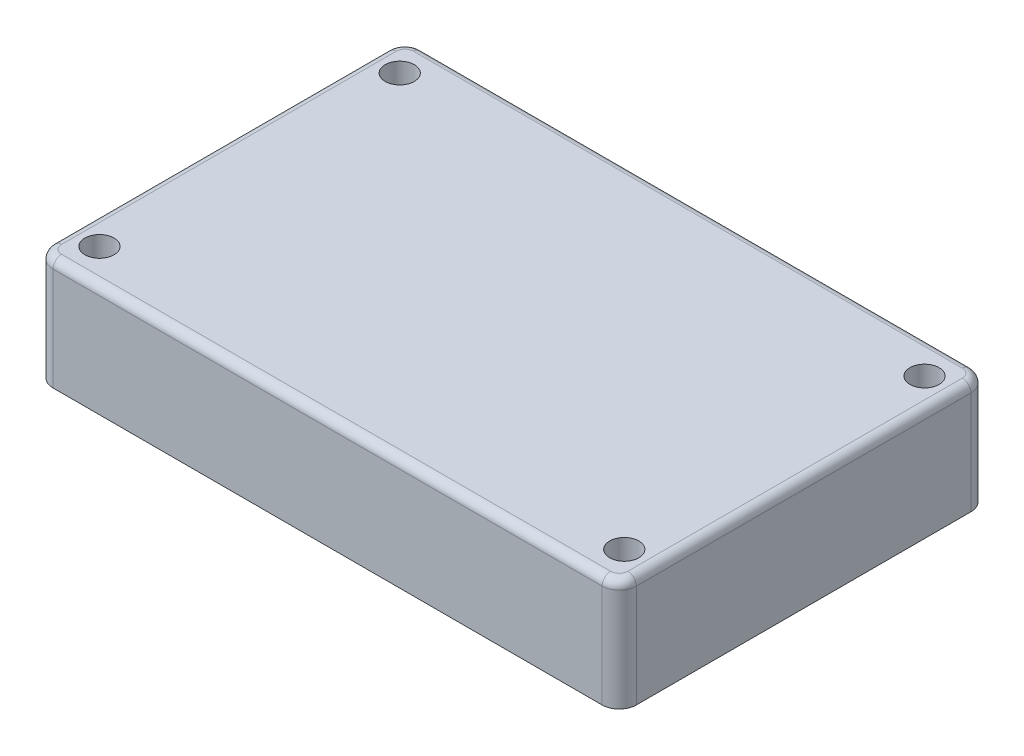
ISO-10303-21;
HEADER;
FILE_DESCRIPTION(('STEP AP214'),'2;1');
FILE_NAME('part.step','',(''),(''),'','','');
FILE_SCHEMA(('AUTOMOTIVE_DESIGN { 1 0 10303 214 1 1 1 1 }'));
ENDSEC;
DATA;
#1=APPLICATION_CONTEXT('core data for automotive mechanical design processes');
#2=APPLICATION_PROTOCOL_DEFINITION('international standard','automotive_design',2000,#1);
#3=PRODUCT_CONTEXT('',#1,'mechanical');
#4=PRODUCT('Part','Part','',(#3));
#5=PRODUCT_RELATED_PRODUCT_CATEGORY('part','',(#4));
#6=PRODUCT_DEFINITION_FORMATION('','',#4);
#7=PRODUCT_DEFINITION_CONTEXT('part definition',#1,'design');
#8=PRODUCT_DEFINITION('design','',#6,#7);
#9=PRODUCT_DEFINITION_SHAPE('','',#8);
#10=(LENGTH_UNIT() NAMED_UNIT(*) SI_UNIT(.MILLI.,.METRE.));
#11=(NAMED_UNIT(*) PLANE_ANGLE_UNIT() SI_UNIT($,.RADIAN.));
#12=(NAMED_UNIT(*) SI_UNIT($,.STERADIAN.) SOLID_ANGLE_UNIT());
#13=UNCERTAINTY_MEASURE_WITH_UNIT(LENGTH_MEASURE(1.E-05),#10,'distance_accuracy_value','');
#14=(GEOMETRIC_REPRESENTATION_CONTEXT(3) GLOBAL_UNCERTAINTY_ASSIGNED_CONTEXT((#13)) GLOBAL_UNIT_ASSIGNED_CONTEXT((#10,
#11,#12)) REPRESENTATION_CONTEXT('',''));
#15=CARTESIAN_POINT('',(0.,0.,0.));
#16=DIRECTION('',(0.,0.,1.));
#17=DIRECTION('',(1.,0.,0.));
#18=AXIS2_PLACEMENT_3D('',#15,#16,#17);
#19=CARTESIAN_POINT('',(31.,23.8619037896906,2.));
#20=DIRECTION('',(0.,-1.,0.));
#21=DIRECTION('',(0.,0.,-1.));
#22=AXIS2_PLACEMENT_3D('',#19,#20,#21);
#23=CYLINDRICAL_SURFACE('',#22,3.);
#24=DIRECTION('',(0.,-1.,0.));
#25=VECTOR('',#24,1.);
#26=CARTESIAN_POINT('',(28.,23.8619037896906,2.));
#27=LINE('',#26,#25);
#28=CARTESIAN_POINT('',(28.,12.2,2.));
#29=VERTEX_POINT('',#28);
#30=CARTESIAN_POINT('',(28.,8.52820323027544,2.));
#31=VERTEX_POINT('',#30);
#32=EDGE_CURVE('E641',#29,#31,#27,.T.);
#33=ORIENTED_EDGE('',*,*,#32,.T.);
#34=CARTESIAN_POINT('',(28.,8.5282032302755,2.));
#35=CARTESIAN_POINT('',(27.9999993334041,8.52820733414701,2.01312347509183));
#36=CARTESIAN_POINT('',(28.0000861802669,8.52760619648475,2.02623972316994));
#37=CARTESIAN_POINT('',(28.0004285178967,8.52523341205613,2.05234854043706));
#38=CARTESIAN_POINT('',(28.0006838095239,8.5234631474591,2.0653412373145));
#39=CARTESIAN_POINT('',(28.001684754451,8.51651434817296,2.1036966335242));
#40=CARTESIAN_POINT('',(28.0026658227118,8.50969561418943,2.12876705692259));
#41=CARTESIAN_POINT('',(28.0054919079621,8.4899593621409,2.18407592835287));
#42=CARTESIAN_POINT('',(28.0074984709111,8.47589370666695,2.21388710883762));
#43=CARTESIAN_POINT('',(28.012122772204,8.44319841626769,2.27095303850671));
#44=CARTESIAN_POINT('',(28.0147436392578,8.42454539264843,2.29819366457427));
#45=CARTESIAN_POINT('',(28.0222178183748,8.3707835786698,2.36698936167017));
#46=CARTESIAN_POINT('',(28.0274123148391,8.33287662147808,2.40629326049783));
#47=CARTESIAN_POINT('',(28.0382613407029,8.25191177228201,2.47901506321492));
#48=CARTESIAN_POINT('',(28.0439169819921,8.20884130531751,2.51241808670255));
#49=CARTESIAN_POINT('',(28.0554577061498,8.11859756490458,2.57506577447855));
#50=CARTESIAN_POINT('',(28.0613451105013,8.07136116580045,2.6042177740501));
#51=CARTESIAN_POINT('',(28.0730293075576,7.9745902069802,2.65849222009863));
#52=CARTESIAN_POINT('',(28.0788259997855,7.92505331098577,2.68361044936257));
#53=CARTESIAN_POINT('',(28.0901764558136,7.82434642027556,2.73041488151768));
#54=CARTESIAN_POINT('',(28.0957301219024,7.7731757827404,2.75209971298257));
#55=CARTESIAN_POINT('',(28.1064782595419,7.66961260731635,2.79244305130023));
#56=CARTESIAN_POINT('',(28.111672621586,7.61721970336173,2.81110063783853));
#57=CARTESIAN_POINT('',(28.125049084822,7.47479351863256,2.85766682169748));
#58=CARTESIAN_POINT('',(28.1328026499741,7.38387407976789,2.8830085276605));
#59=CARTESIAN_POINT('',(28.1465492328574,7.20019581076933,2.92646242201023));
#60=CARTESIAN_POINT('',(28.152541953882,7.10743667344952,2.94457339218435));
#61=CARTESIAN_POINT('',(28.1612829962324,6.94034590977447,2.97047877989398));
#62=CARTESIAN_POINT('',(28.1644487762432,6.86624694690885,2.97964252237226));
#63=CARTESIAN_POINT('',(28.1691567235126,6.71751638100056,2.99316597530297));
#64=CARTESIAN_POINT('',(28.1706981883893,6.64288456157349,2.99752360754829));
#65=CARTESIAN_POINT('',(28.1718903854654,6.4935609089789,3.00089975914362));
#66=CARTESIAN_POINT('',(28.1715434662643,6.41886926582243,2.99992491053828));
#67=CARTESIAN_POINT('',(28.1686938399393,6.26989605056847,2.99182965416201));
#68=CARTESIAN_POINT('',(28.1661930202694,6.19561417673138,2.98471462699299));
#69=CARTESIAN_POINT('',(28.1586853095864,6.04593449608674,2.9628465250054));
#70=CARTESIAN_POINT('',(28.1536042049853,5.97057190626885,2.9478667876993));
#71=CARTESIAN_POINT('',(28.140777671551,5.82257179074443,2.90845263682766));
#72=CARTESIAN_POINT('',(28.1330355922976,5.74993096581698,2.88403010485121));
#73=CARTESIAN_POINT('',(28.1166924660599,5.62179226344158,2.82898019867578));
#74=CARTESIAN_POINT('',(28.108466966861,5.56549205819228,2.80013744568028));
#75=CARTESIAN_POINT('',(28.0909049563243,5.45846139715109,2.73371845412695));
#76=CARTESIAN_POINT('',(28.0815700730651,5.4077229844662,2.69615493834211));
#77=CARTESIAN_POINT('',(28.0645778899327,5.32321401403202,2.62008488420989));
#78=CARTESIAN_POINT('',(28.0569401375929,5.28805284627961,2.58312411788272));
#79=CARTESIAN_POINT('',(28.042316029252,5.22435773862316,2.50371635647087));
#80=CARTESIAN_POINT('',(28.0353295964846,5.1958230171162,2.46127000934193));
#81=CARTESIAN_POINT('',(28.0227634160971,5.14645293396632,2.37164137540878));
#82=CARTESIAN_POINT('',(28.01719053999,5.12565496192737,2.3244374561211));
#83=CARTESIAN_POINT('',(28.0081944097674,5.09280574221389,2.22690185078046));
#84=CARTESIAN_POINT('',(28.0047684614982,5.08074352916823,2.17657417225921));
#85=CARTESIAN_POINT('',(28.00175764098,5.07020789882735,2.10479295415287));
#86=CARTESIAN_POINT('',(28.001099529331,5.06791730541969,2.08388482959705));
#87=CARTESIAN_POINT('',(28.0002209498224,5.06486625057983,2.04198816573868));
#88=CARTESIAN_POINT('',(27.9999996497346,5.06410287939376,2.02099985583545));
#89=CARTESIAN_POINT('',(28.,5.06410161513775,2.));
#90=B_SPLINE_CURVE_WITH_KNOTS('',3,(#34,#35,#36,#37,#38,#39,#40,#41,#42,#43,#44,#45,#46,#47,#48,
#49,#50,#51,#52,#53,#54,#55,#56,#57,#58,#59,#60,#61,#62,#63,#64,#65,#66,#67,#68,#69,#70,#71,#72,
#73,#74,#75,#76,#77,#78,#79,#80,#81,#82,#83,#84,#85,#86,#87,#88,#89),.UNSPECIFIED.,.F.,.F.,(4,2,
2,2,2,2,2,2,2,2,2,2,2,2,2,2,2,2,2,2,2,2,2,2,2,2,2,4),(0.,0.0393431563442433,0.0786398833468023,
0.15625651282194,0.254783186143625,0.353823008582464,0.517455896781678,0.68149570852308,
0.848700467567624,1.01607891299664,1.18352404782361,1.35101999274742,1.6347674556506,
1.91856270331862,2.14259877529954,2.36673168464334,2.59058590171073,2.81424415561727,
3.04473394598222,3.27493465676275,3.46562171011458,3.65603229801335,3.81013302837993,
3.96421557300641,4.11903336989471,4.27365649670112,4.3367383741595,4.39969994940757),.UNSPECIFIED.);
#91=CARTESIAN_POINT('',(28.,5.06410161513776,2.));
#92=VERTEX_POINT('',#91);
#93=EDGE_CURVE('E354',#31,#92,#90,.T.);
#94=ORIENTED_EDGE('',*,*,#93,.T.);
#95=CARTESIAN_POINT('',(28.,1.6,2.));
#96=VERTEX_POINT('',#95);
#97=EDGE_CURVE('E647',#92,#96,#27,.T.);
#98=ORIENTED_EDGE('',*,*,#97,.T.);
#99=CARTESIAN_POINT('',(31.,1.6,2.));
#100=DIRECTION('',(0.,-1.,0.));
#101=DIRECTION('',(0.,0.,-1.));
#102=AXIS2_PLACEMENT_3D('',#99,#100,#101);
#103=CIRCLE('',#102,3.);
#104=CARTESIAN_POINT('',(29.1999999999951,1.6,4.39999999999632));
#105=VERTEX_POINT('',#104);
#106=EDGE_CURVE('E840',#105,#96,#103,.T.);
#107=ORIENTED_EDGE('',*,*,#106,.F.);
#108=DIRECTION('',(0.,-1.,0.));
#109=VECTOR('',#108,1.);
#110=CARTESIAN_POINT('',(29.1999999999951,23.8619037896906,4.39999999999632));
#111=LINE('',#110,#109);
#112=CARTESIAN_POINT('',(29.1999999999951,12.2,4.39999999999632));
#113=VERTEX_POINT('',#112);
#114=EDGE_CURVE('E745',#105,#113,#111,.F.);
#115=ORIENTED_EDGE('',*,*,#114,.T.);
#116=CARTESIAN_POINT('',(31.,12.2,2.));
#117=DIRECTION('',(0.,-1.,0.));
#118=DIRECTION('',(0.,0.,-1.));
#119=AXIS2_PLACEMENT_3D('',#116,#117,#118);
#120=CIRCLE('',#119,3.);
#121=EDGE_CURVE('E637',#29,#113,#120,.F.);
#122=ORIENTED_EDGE('',*,*,#121,.F.);
#123=EDGE_LOOP('',(#33,#94,#98,#107,#115,#122));
#124=FACE_BOUND('',#123,.T.);
#125=ADVANCED_FACE('F40',(#124),#23,.T.);
#126=CARTESIAN_POINT('',(31.,23.8619037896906,-2.));
#127=DIRECTION('',(0.,-1.,0.));
#128=DIRECTION('',(0.,0.,-1.));
#129=AXIS2_PLACEMENT_3D('',#126,#127,#128);
#130=CYLINDRICAL_SURFACE('',#129,3.);
#131=DIRECTION('',(0.,-1.,0.));
#132=VECTOR('',#131,1.);
#133=CARTESIAN_POINT('',(28.,23.8619037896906,-2.));
#134=LINE('',#133,#132);
#135=CARTESIAN_POINT('',(28.,5.06410161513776,-2.));
#136=VERTEX_POINT('',#135);
#137=CARTESIAN_POINT('',(28.,1.6,-2.));
#138=VERTEX_POINT('',#137);
#139=EDGE_CURVE('E628',#136,#138,#134,.T.);
#140=ORIENTED_EDGE('',*,*,#139,.F.);
#141=CARTESIAN_POINT('',(28.,5.06410161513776,-2.));
#142=CARTESIAN_POINT('',(27.9999984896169,5.06410177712,-2.02372511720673));
#143=CARTESIAN_POINT('',(28.0002817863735,5.06507720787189,-2.04743864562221));
#144=CARTESIAN_POINT('',(28.0014018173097,5.06896804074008,-2.09468950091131));
#145=CARTESIAN_POINT('',(28.0022384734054,5.07188316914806,-2.11822685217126));
#146=CARTESIAN_POINT('',(28.0055462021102,5.08349408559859,-2.18818300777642));
#147=CARTESIAN_POINT('',(28.0088152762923,5.0950556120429,-2.2341228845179));
#148=CARTESIAN_POINT('',(28.0171359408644,5.12547360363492,-2.32331871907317));
#149=CARTESIAN_POINT('',(28.0221876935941,5.14433073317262,-2.36657443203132));
#150=CARTESIAN_POINT('',(28.033547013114,5.1887074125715,-2.44933617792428));
#151=CARTESIAN_POINT('',(28.0398547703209,5.21422797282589,-2.48884164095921));
#152=CARTESIAN_POINT('',(28.0533363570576,5.27197935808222,-2.56453900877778));
#153=CARTESIAN_POINT('',(28.0605319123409,5.3044039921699,-2.60057835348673));
#154=CARTESIAN_POINT('',(28.0749778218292,5.37424761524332,-2.66739401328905));
#155=CARTESIAN_POINT('',(28.0822282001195,5.41166893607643,-2.69816785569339));
#156=CARTESIAN_POINT('',(28.0994688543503,5.50829314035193,-2.76727927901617));
#157=CARTESIAN_POINT('',(28.1092015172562,5.56964911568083,-2.80267015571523));
#158=CARTESIAN_POINT('',(28.1267408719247,5.69746323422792,-2.8633550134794));
#159=CARTESIAN_POINT('',(28.134542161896,5.76393502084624,-2.88862079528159));
#160=CARTESIAN_POINT('',(28.1463936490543,5.88459276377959,-2.92585823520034));
#161=CARTESIAN_POINT('',(28.1508921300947,5.93822897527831,-2.93953613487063));
#162=CARTESIAN_POINT('',(28.1585224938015,6.04657305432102,-2.96236766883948));
#163=CARTESIAN_POINT('',(28.1616535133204,6.10128157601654,-2.9715184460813));
#164=CARTESIAN_POINT('',(28.1666092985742,6.21125346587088,-2.98587708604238));
#165=CARTESIAN_POINT('',(28.1684341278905,6.26651680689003,-2.99108514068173));
#166=CARTESIAN_POINT('',(28.1708777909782,6.37729362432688,-2.99803789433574));
#167=CARTESIAN_POINT('',(28.1714962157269,6.43280717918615,-2.99978141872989));
#168=CARTESIAN_POINT('',(28.1716799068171,6.57858672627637,-3.00030558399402));
#169=CARTESIAN_POINT('',(28.1703442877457,6.66886733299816,-2.99655029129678));
#170=CARTESIAN_POINT('',(28.1652411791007,6.84891718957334,-2.98193599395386));
#171=CARTESIAN_POINT('',(28.1614690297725,6.93868512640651,-2.971063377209));
#172=CARTESIAN_POINT('',(28.1518450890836,7.1185103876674,-2.94246838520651));
#173=CARTESIAN_POINT('',(28.1459605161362,7.20854873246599,-2.92463762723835));
#174=CARTESIAN_POINT('',(28.1325313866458,7.38697963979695,-2.88211224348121));
#175=CARTESIAN_POINT('',(28.1249848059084,7.4753700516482,-2.85740923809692));
#176=CARTESIAN_POINT('',(28.1086752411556,7.64923935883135,-2.80069915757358));
#177=CARTESIAN_POINT('',(28.0999184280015,7.73473044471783,-2.76872863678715));
#178=CARTESIAN_POINT('',(28.0862058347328,7.85996363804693,-2.71424595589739));
#179=CARTESIAN_POINT('',(28.081542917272,7.90117396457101,-2.6950162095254));
#180=CARTESIAN_POINT('',(28.0720962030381,7.98232467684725,-2.65408143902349));
#181=CARTESIAN_POINT('',(28.0673124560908,8.02226557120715,-2.63237742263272));
#182=CARTESIAN_POINT('',(28.0576906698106,8.10066507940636,-2.58598695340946));
#183=CARTESIAN_POINT('',(28.0528524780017,8.13911509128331,-2.56128584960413));
#184=CARTESIAN_POINT('',(28.0432717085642,8.2136840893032,-2.50841054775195));
#185=CARTESIAN_POINT('',(28.038529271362,8.24979980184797,-2.48023162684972));
#186=CARTESIAN_POINT('',(28.0292999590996,8.31887821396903,-2.41940728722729));
#187=CARTESIAN_POINT('',(28.0248164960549,8.35180156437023,-2.38671585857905));
#188=CARTESIAN_POINT('',(28.0165148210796,8.41193822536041,-2.31632580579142));
#189=CARTESIAN_POINT('',(28.012694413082,8.43917044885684,-2.27864446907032));
#190=CARTESIAN_POINT('',(28.0075931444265,8.47521503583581,-2.2146286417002));
#191=CARTESIAN_POINT('',(28.0059142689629,8.48699527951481,-2.19000853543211));
#192=CARTESIAN_POINT('',(28.0031246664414,8.5065006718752,-2.13921107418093));
#193=CARTESIAN_POINT('',(28.0020121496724,8.51423859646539,-2.11303892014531));
#194=CARTESIAN_POINT('',(28.0008351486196,8.52241346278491,-2.07219907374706));
#195=CARTESIAN_POINT('',(28.0005238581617,8.52457242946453,-2.05787068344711));
#196=CARTESIAN_POINT('',(28.0001055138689,8.52747223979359,-2.0290319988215));
#197=CARTESIAN_POINT('',(27.9999989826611,8.52820945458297,-2.01452133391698));
#198=CARTESIAN_POINT('',(28.,8.5282032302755,-2.));
#199=B_SPLINE_CURVE_WITH_KNOTS('',3,(#141,#142,#143,#144,#145,#146,#147,#148,#149,#150,#151,
#152,#153,#154,#155,#156,#157,#158,#159,#160,#161,#162,#163,#164,#165,#166,#167,#168,#169,#170,
#171,#172,#173,#174,#175,#176,#177,#178,#179,#180,#181,#182,#183,#184,#185,#186,#187,#188,#189,
#190,#191,#192,#193,#194,#195,#196,#197,#198),.UNSPECIFIED.,.F.,.F.,(4,2,2,2,2,2,2,2,2,2,2,2,2,
2,2,2,2,2,2,2,2,2,2,2,2,2,2,2,4),(0.,0.0711307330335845,0.142251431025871,0.283968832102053,
0.425699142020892,0.567450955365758,0.713885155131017,0.860387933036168,1.07367295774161,
1.28754793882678,1.45392773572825,1.62041240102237,1.7868889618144,1.95342195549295,
2.22413737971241,2.49537207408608,2.77101204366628,3.04698959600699,3.32160859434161,
3.45868703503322,3.59570984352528,3.7334317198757,3.87134272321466,4.01078108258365,
4.14974841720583,4.23150988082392,4.31301134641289,4.35642628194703,4.39995188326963),.UNSPECIFIED.);
#200=CARTESIAN_POINT('',(28.,8.52820323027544,-2.));
#201=VERTEX_POINT('',#200);
#202=EDGE_CURVE('E293',#136,#201,#199,.T.);
#203=ORIENTED_EDGE('',*,*,#202,.T.);
#204=CARTESIAN_POINT('',(28.,12.2,-2.));
#205=VERTEX_POINT('',#204);
#206=EDGE_CURVE('E625',#205,#201,#134,.T.);
#207=ORIENTED_EDGE('',*,*,#206,.F.);
#208=CARTESIAN_POINT('',(31.,12.2,-2.));
#209=DIRECTION('',(0.,-1.,0.));
#210=DIRECTION('',(0.,0.,-1.));
#211=AXIS2_PLACEMENT_3D('',#208,#209,#210);
#212=CIRCLE('',#211,3.);
#213=CARTESIAN_POINT('',(29.1999999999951,12.2,-4.39999999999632));
#214=VERTEX_POINT('',#213);
#215=EDGE_CURVE('E709',#205,#214,#212,.T.);
#216=ORIENTED_EDGE('',*,*,#215,.T.);
#217=DIRECTION('',(0.,-1.,0.));
#218=VECTOR('',#217,1.);
#219=CARTESIAN_POINT('',(29.1999999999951,23.8619037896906,-4.39999999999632));
#220=LINE('',#219,#218);
#221=CARTESIAN_POINT('',(29.1999999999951,1.6,-4.39999999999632));
#222=VERTEX_POINT('',#221);
#223=EDGE_CURVE('E737',#214,#222,#220,.T.);
#224=ORIENTED_EDGE('',*,*,#223,.T.);
#225=CARTESIAN_POINT('',(31.,1.6,-2.));
#226=DIRECTION('',(0.,-1.,0.));
#227=DIRECTION('',(0.,0.,-1.));
#228=AXIS2_PLACEMENT_3D('',#225,#226,#227);
#229=CIRCLE('',#228,3.);
#230=EDGE_CURVE('E644',#138,#222,#229,.T.);
#231=ORIENTED_EDGE('',*,*,#230,.F.);
#232=EDGE_LOOP('',(#140,#203,#207,#216,#224,#231));
#233=FACE_BOUND('',#232,.T.);
#234=ADVANCED_FACE('F375',(#233),#130,.T.);
#235=CARTESIAN_POINT('',(28.,23.8619037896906,2.));
#236=DIRECTION('',(-1.,0.,0.));
#237=DIRECTION('',(0.,0.,1.));
#238=AXIS2_PLACEMENT_3D('',#235,#236,#237);
#239=PLANE('',#238);
#240=ORIENTED_EDGE('',*,*,#97,.F.);
#241=DIRECTION('',(0.,0.,-1.));
#242=VECTOR('',#241,1.);
#243=CARTESIAN_POINT('',(28.,5.06410161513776,2.));
#244=LINE('',#243,#242);
#245=EDGE_CURVE('E617',#92,#136,#244,.T.);
#246=ORIENTED_EDGE('',*,*,#245,.T.);
#247=ORIENTED_EDGE('',*,*,#139,.T.);
#248=DIRECTION('',(0.,0.,-1.));
#249=VECTOR('',#248,1.);
#250=CARTESIAN_POINT('',(28.,1.6,2.));
#251=LINE('',#250,#249);
#252=EDGE_CURVE('E839',#96,#138,#251,.T.);
#253=ORIENTED_EDGE('',*,*,#252,.F.);
#254=EDGE_LOOP('',(#240,#246,#247,#253));
#255=FACE_BOUND('',#254,.T.);
#256=ADVANCED_FACE('F377',(#255),#239,.T.);
#257=ORIENTED_EDGE('',*,*,#206,.T.);
#258=DIRECTION('',(0.,0.,1.));
#259=VECTOR('',#258,1.);
#260=CARTESIAN_POINT('',(28.,8.52820323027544,-2.));
#261=LINE('',#260,#259);
#262=EDGE_CURVE('E634',#201,#31,#261,.T.);
#263=ORIENTED_EDGE('',*,*,#262,.T.);
#264=ORIENTED_EDGE('',*,*,#32,.F.);
#265=DIRECTION('',(0.,0.,1.));
#266=VECTOR('',#265,1.);
#267=CARTESIAN_POINT('',(28.,12.2,2.));
#268=LINE('',#267,#266);
#269=EDGE_CURVE('E636',#205,#29,#268,.T.);
#270=ORIENTED_EDGE('',*,*,#269,.F.);
#271=EDGE_LOOP('',(#257,#263,#264,#270));
#272=FACE_BOUND('',#271,.T.);
#273=ADVANCED_FACE('F631',(#272),#239,.T.);
#274=CARTESIAN_POINT('',(29.9999999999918,14.6,291545.));
#275=DIRECTION('',(1.,0.,0.));
#276=DIRECTION('',(0.,0.,-1.));
#277=AXIS2_PLACEMENT_3D('',#274,#275,#276);
#278=PLANE('',#277);
#279=DIRECTION('',(0.,0.,1.));
#280=VECTOR('',#279,1.);
#281=CARTESIAN_POINT('',(29.9999999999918,12.2,0.));
#282=LINE('',#281,#280);
#283=CARTESIAN_POINT('',(29.9999999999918,12.2,5.99999999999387));
#284=VERTEX_POINT('',#283);
#285=CARTESIAN_POINT('',(29.9999999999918,12.2,9.77259338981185));
#286=VERTEX_POINT('',#285);
#287=EDGE_CURVE('E655',#284,#286,#282,.T.);
#288=ORIENTED_EDGE('',*,*,#287,.F.);
#289=DIRECTION('',(0.,-1.,0.));
#290=VECTOR('',#289,1.);
#291=CARTESIAN_POINT('',(29.9999999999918,14.6,5.99999999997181));
#292=LINE('',#291,#290);
#293=CARTESIAN_POINT('',(29.9999999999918,1.6,5.99999999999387));
#294=VERTEX_POINT('',#293);
#295=EDGE_CURVE('E742',#284,#294,#292,.T.);
#296=ORIENTED_EDGE('',*,*,#295,.T.);
#297=DIRECTION('',(0.,0.,1.));
#298=VECTOR('',#297,1.);
#299=CARTESIAN_POINT('',(29.9999999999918,1.6,0.));
#300=LINE('',#299,#298);
#301=CARTESIAN_POINT('',(29.9999999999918,1.6,9.77259338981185));
#302=VERTEX_POINT('',#301);
#303=EDGE_CURVE('E672',#294,#302,#300,.T.);
#304=ORIENTED_EDGE('',*,*,#303,.T.);
#305=DIRECTION('',(0.,-1.,0.));
#306=VECTOR('',#305,1.);
#307=CARTESIAN_POINT('',(29.9999999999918,12.2,9.77259338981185));
#308=LINE('',#307,#306);
#309=EDGE_CURVE('E739',#302,#286,#308,.F.);
#310=ORIENTED_EDGE('',*,*,#309,.T.);
#311=EDGE_LOOP('',(#288,#296,#304,#310));
#312=FACE_BOUND('',#311,.T.);
#313=ADVANCED_FACE('F387',(#312),#278,.F.);
#314=CARTESIAN_POINT('',(-400000.,14.6,21.50000000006));
#315=DIRECTION('',(0.,0.,1.));
#316=DIRECTION('',(1.,0.,0.));
#317=AXIS2_PLACEMENT_3D('',#314,#315,#316);
#318=PLANE('',#317);
#319=DIRECTION('',(0.,-1.,0.));
#320=VECTOR('',#319,1.);
#321=CARTESIAN_POINT('',(31.9999999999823,14.6,21.5000000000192));
#322=LINE('',#321,#320);
#323=CARTESIAN_POINT('',(31.9999999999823,1.6,21.5000000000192));
#324=VERTEX_POINT('',#323);
#325=CARTESIAN_POINT('',(31.9999999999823,13.6,21.5000000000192));
#326=VERTEX_POINT('',#325);
#327=EDGE_CURVE('E603',#324,#326,#322,.F.);
#328=ORIENTED_EDGE('',*,*,#327,.T.);
#329=DIRECTION('',(-1.,0.,0.));
#330=VECTOR('',#329,1.);
#331=CARTESIAN_POINT('',(-31.9999999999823,13.6,21.5000000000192));
#332=LINE('',#331,#330);
#333=CARTESIAN_POINT('',(-31.9999999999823,13.6,21.5000000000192));
#334=VERTEX_POINT('',#333);
#335=EDGE_CURVE('E11',#326,#334,#332,.T.);
#336=ORIENTED_EDGE('',*,*,#335,.T.);
#337=DIRECTION('',(0.,-1.,0.));
#338=VECTOR('',#337,1.);
#339=CARTESIAN_POINT('',(-31.9999999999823,14.6,21.5000000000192));
#340=LINE('',#339,#338);
#341=CARTESIAN_POINT('',(-31.9999999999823,1.6,21.5000000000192));
#342=VERTEX_POINT('',#341);
#343=EDGE_CURVE('E606',#334,#342,#340,.T.);
#344=ORIENTED_EDGE('',*,*,#343,.T.);
#345=DIRECTION('',(-1.,0.,0.));
#346=VECTOR('',#345,1.);
#347=CARTESIAN_POINT('',(-400000.,1.6,21.50000000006));
#348=LINE('',#347,#346);
#349=EDGE_CURVE('E675',#324,#342,#348,.T.);
#350=ORIENTED_EDGE('',*,*,#349,.F.);
#351=EDGE_LOOP('',(#328,#336,#344,#350));
#352=FACE_BOUND('',#351,.T.);
#353=ADVANCED_FACE('F411',(#352),#318,.T.);
#354=CARTESIAN_POINT('',(33.9999999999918,14.6,291545.));
#355=DIRECTION('',(1.,0.,0.));
#356=DIRECTION('',(0.,0.,-1.));
#357=AXIS2_PLACEMENT_3D('',#354,#355,#356);
#358=PLANE('',#357);
#359=DIRECTION('',(0.,-1.,0.));
#360=VECTOR('',#359,1.);
#361=CARTESIAN_POINT('',(33.9999999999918,14.6,-19.4999999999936));
#362=LINE('',#361,#360);
#363=CARTESIAN_POINT('',(33.9999999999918,1.6,-19.4999999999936));
#364=VERTEX_POINT('',#363);
#365=CARTESIAN_POINT('',(33.9999999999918,13.6,-19.4999999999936));
#366=VERTEX_POINT('',#365);
#367=EDGE_CURVE('E615',#364,#366,#362,.F.);
#368=ORIENTED_EDGE('',*,*,#367,.T.);
#369=DIRECTION('',(0.,0.,1.));
#370=VECTOR('',#369,1.);
#371=CARTESIAN_POINT('',(33.9999999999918,13.6,19.5000000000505));
#372=LINE('',#371,#370);
#373=CARTESIAN_POINT('',(33.9999999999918,13.6,19.5000000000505));
#374=VERTEX_POINT('',#373);
#375=EDGE_CURVE('E562',#366,#374,#372,.T.);
#376=ORIENTED_EDGE('',*,*,#375,.T.);
#377=DIRECTION('',(0.,-1.,0.));
#378=VECTOR('',#377,1.);
#379=CARTESIAN_POINT('',(33.9999999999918,14.6,19.5000000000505));
#380=LINE('',#379,#378);
#381=CARTESIAN_POINT('',(33.9999999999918,1.6,19.5000000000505));
#382=VERTEX_POINT('',#381);
#383=EDGE_CURVE('E613',#374,#382,#380,.T.);
#384=ORIENTED_EDGE('',*,*,#383,.T.);
#385=DIRECTION('',(0.,0.,1.));
#386=VECTOR('',#385,1.);
#387=CARTESIAN_POINT('',(33.9999999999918,1.6,291545.));
#388=LINE('',#387,#386);
#389=EDGE_CURVE('E682',#364,#382,#388,.T.);
#390=ORIENTED_EDGE('',*,*,#389,.F.);
#391=EDGE_LOOP('',(#368,#376,#384,#390));
#392=FACE_BOUND('',#391,.T.);
#393=ADVANCED_FACE('F407',(#392),#358,.T.);
#394=CARTESIAN_POINT('',(-400000.,14.6,-21.4999999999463));
#395=DIRECTION('',(0.,0.,-1.));
#396=DIRECTION('',(-1.,0.,0.));
#397=AXIS2_PLACEMENT_3D('',#394,#395,#396);
#398=PLANE('',#397);
#399=DIRECTION('',(0.,-1.,0.));
#400=VECTOR('',#399,1.);
#401=CARTESIAN_POINT('',(-31.9999999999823,14.6,-21.4999999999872));
#402=LINE('',#401,#400);
#403=CARTESIAN_POINT('',(-31.9999999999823,1.6,-21.4999999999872));
#404=VERTEX_POINT('',#403);
#405=CARTESIAN_POINT('',(-31.9999999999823,13.6,-21.4999999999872));
#406=VERTEX_POINT('',#405);
#407=EDGE_CURVE('E597',#404,#406,#402,.F.);
#408=ORIENTED_EDGE('',*,*,#407,.T.);
#409=DIRECTION('',(1.,0.,0.));
#410=VECTOR('',#409,1.);
#411=CARTESIAN_POINT('',(31.9999999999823,13.6,-21.4999999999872));
#412=LINE('',#411,#410);
#413=CARTESIAN_POINT('',(31.9999999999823,13.6,-21.4999999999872));
#414=VERTEX_POINT('',#413);
#415=EDGE_CURVE('E558',#406,#414,#412,.T.);
#416=ORIENTED_EDGE('',*,*,#415,.T.);
#417=DIRECTION('',(0.,-1.,0.));
#418=VECTOR('',#417,1.);
#419=CARTESIAN_POINT('',(31.9999999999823,14.6,-21.4999999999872));
#420=LINE('',#419,#418);
#421=CARTESIAN_POINT('',(31.9999999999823,1.6,-21.4999999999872));
#422=VERTEX_POINT('',#421);
#423=EDGE_CURVE('E604',#414,#422,#420,.T.);
#424=ORIENTED_EDGE('',*,*,#423,.T.);
#425=DIRECTION('',(1.,0.,0.));
#426=VECTOR('',#425,1.);
#427=CARTESIAN_POINT('',(-400000.,1.6,-21.4999999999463));
#428=LINE('',#427,#426);
#429=EDGE_CURVE('E602',#404,#422,#428,.T.);
#430=ORIENTED_EDGE('',*,*,#429,.F.);
#431=EDGE_LOOP('',(#408,#416,#424,#430));
#432=FACE_BOUND('',#431,.T.);
#433=ADVANCED_FACE('F410',(#432),#398,.T.);
#434=CARTESIAN_POINT('',(-33.9999999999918,14.6,291545.));
#435=DIRECTION('',(-1.,0.,0.));
#436=DIRECTION('',(0.,0.,1.));
#437=AXIS2_PLACEMENT_3D('',#434,#435,#436);
#438=PLANE('',#437);
#439=DIRECTION('',(0.,-1.,0.));
#440=VECTOR('',#439,1.);
#441=CARTESIAN_POINT('',(-33.9999999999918,14.6,19.4999999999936));
#442=LINE('',#441,#440);
#443=CARTESIAN_POINT('',(-33.9999999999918,1.6,19.4999999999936));
#444=VERTEX_POINT('',#443);
#445=CARTESIAN_POINT('',(-33.9999999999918,13.6,19.4999999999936));
#446=VERTEX_POINT('',#445);
#447=EDGE_CURVE('E801',#444,#446,#442,.F.);
#448=ORIENTED_EDGE('',*,*,#447,.T.);
#449=DIRECTION('',(0.,0.,-1.));
#450=VECTOR('',#449,1.);
#451=CARTESIAN_POINT('',(-33.9999999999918,13.6,-19.4999999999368));
#452=LINE('',#451,#450);
#453=CARTESIAN_POINT('',(-33.9999999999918,13.6,-19.4999999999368));
#454=VERTEX_POINT('',#453);
#455=EDGE_CURVE('E527',#446,#454,#452,.T.);
#456=ORIENTED_EDGE('',*,*,#455,.T.);
#457=DIRECTION('',(0.,-1.,0.));
#458=VECTOR('',#457,1.);
#459=CARTESIAN_POINT('',(-33.9999999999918,14.6,-19.4999999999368));
#460=LINE('',#459,#458);
#461=CARTESIAN_POINT('',(-33.9999999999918,1.6,-19.4999999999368));
#462=VERTEX_POINT('',#461);
#463=EDGE_CURVE('E598',#454,#462,#460,.T.);
#464=ORIENTED_EDGE('',*,*,#463,.T.);
#465=DIRECTION('',(0.,0.,-1.));
#466=VECTOR('',#465,1.);
#467=CARTESIAN_POINT('',(-33.9999999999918,1.6,291545.));
#468=LINE('',#467,#466);
#469=EDGE_CURVE('E678',#444,#462,#468,.T.);
#470=ORIENTED_EDGE('',*,*,#469,.F.);
#471=EDGE_LOOP('',(#448,#456,#464,#470));
#472=FACE_BOUND('',#471,.T.);
#473=ADVANCED_FACE('F403',(#472),#438,.T.);
#474=CARTESIAN_POINT('',(0.,14.6,0.));
#475=DIRECTION('',(0.,-1.,0.));
#476=DIRECTION('',(0.,0.,-1.));
#477=AXIS2_PLACEMENT_3D('',#474,#475,#476);
#478=PLANE('',#477);
#479=DIRECTION('',(-1.,0.,0.));
#480=VECTOR('',#479,1.);
#481=CARTESIAN_POINT('',(31.9999999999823,14.6,20.5000000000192));
#482=LINE('',#481,#480);
#483=CARTESIAN_POINT('',(-31.9999999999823,14.6,20.5000000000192));
#484=VERTEX_POINT('',#483);
#485=CARTESIAN_POINT('',(31.999999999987,14.6,20.5000000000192));
#486=VERTEX_POINT('',#485);
#487=EDGE_CURVE('E363',#484,#486,#482,.F.);
#488=ORIENTED_EDGE('',*,*,#487,.T.);
#489=CARTESIAN_POINT('',(31.9999999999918,14.6,19.5000000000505));
#490=DIRECTION('',(0.,-1.,0.));
#491=DIRECTION('',(0.,0.,-1.));
#492=AXIS2_PLACEMENT_3D('',#489,#490,#491);
#493=CIRCLE('',#492,1.);
#494=CARTESIAN_POINT('',(32.9999999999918,14.6,19.5000000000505));
#495=VERTEX_POINT('',#494);
#496=EDGE_CURVE('E567',#486,#495,#493,.F.);
#497=ORIENTED_EDGE('',*,*,#496,.T.);
#498=DIRECTION('',(0.,0.,1.));
#499=VECTOR('',#498,1.);
#500=CARTESIAN_POINT('',(32.9999999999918,14.6,-19.4999999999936));
#501=LINE('',#500,#499);
#502=CARTESIAN_POINT('',(32.9999999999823,14.6,-19.4999999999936));
#503=VERTEX_POINT('',#502);
#504=EDGE_CURVE('E570',#495,#503,#501,.F.);
#505=ORIENTED_EDGE('',*,*,#504,.T.);
#506=CARTESIAN_POINT('',(31.9999999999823,14.6,-19.4999999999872));
#507=DIRECTION('',(0.,-1.,0.));
#508=DIRECTION('',(0.,0.,-1.));
#509=AXIS2_PLACEMENT_3D('',#506,#507,#508);
#510=CIRCLE('',#509,1.);
#511=CARTESIAN_POINT('',(31.9999999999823,14.6,-20.4999999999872));
#512=VERTEX_POINT('',#511);
#513=EDGE_CURVE('E572',#503,#512,#510,.F.);
#514=ORIENTED_EDGE('',*,*,#513,.T.);
#515=DIRECTION('',(1.,0.,0.));
#516=VECTOR('',#515,1.);
#517=CARTESIAN_POINT('',(-31.9999999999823,14.6,-20.4999999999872));
#518=LINE('',#517,#516);
#519=CARTESIAN_POINT('',(-31.9999999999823,14.6,-20.4999999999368));
#520=VERTEX_POINT('',#519);
#521=EDGE_CURVE('E574',#512,#520,#518,.F.);
#522=ORIENTED_EDGE('',*,*,#521,.T.);
#523=CARTESIAN_POINT('',(-31.9999999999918,14.6,-19.4999999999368));
#524=DIRECTION('',(0.,-1.,0.));
#525=DIRECTION('',(0.,0.,-1.));
#526=AXIS2_PLACEMENT_3D('',#523,#524,#525);
#527=CIRCLE('',#526,1.);
#528=CARTESIAN_POINT('',(-32.9999999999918,14.6,-19.4999999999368));
#529=VERTEX_POINT('',#528);
#530=EDGE_CURVE('E576',#520,#529,#527,.F.);
#531=ORIENTED_EDGE('',*,*,#530,.T.);
#532=DIRECTION('',(0.,0.,-1.));
#533=VECTOR('',#532,1.);
#534=CARTESIAN_POINT('',(-32.9999999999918,14.6,19.4999999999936));
#535=LINE('',#534,#533);
#536=CARTESIAN_POINT('',(-32.9999999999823,14.6,19.4999999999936));
#537=VERTEX_POINT('',#536);
#538=EDGE_CURVE('E529',#529,#537,#535,.F.);
#539=ORIENTED_EDGE('',*,*,#538,.T.);
#540=CARTESIAN_POINT('',(-31.9999999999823,14.6,19.5000000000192));
#541=DIRECTION('',(0.,-1.,0.));
#542=DIRECTION('',(0.,0.,-1.));
#543=AXIS2_PLACEMENT_3D('',#540,#541,#542);
#544=CIRCLE('',#543,1.);
#545=EDGE_CURVE('E578',#537,#484,#544,.F.);
#546=ORIENTED_EDGE('',*,*,#545,.T.);
#547=EDGE_LOOP('',(#488,#497,#505,#514,#522,#531,#539,#546));
#548=FACE_BOUND('',#547,.T.);
#549=CARTESIAN_POINT('',(30.5885113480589,14.6,-17.5));
#550=DIRECTION('',(0.,1.,0.));
#551=DIRECTION('',(0.,0.,1.));
#552=AXIS2_PLACEMENT_3D('',#549,#550,#551);
#553=CIRCLE('',#552,1.69999999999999);
#554=CARTESIAN_POINT('',(30.5885113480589,14.6,-15.8));
#555=VERTEX_POINT('',#554);
#556=EDGE_CURVE('E312',#555,#555,#553,.T.);
#557=ORIENTED_EDGE('',*,*,#556,.F.);
#558=EDGE_LOOP('',(#557));
#559=FACE_BOUND('',#558,.T.);
#560=CARTESIAN_POINT('',(-30.5885113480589,14.6,-17.5));
#561=DIRECTION('',(0.,1.,0.));
#562=DIRECTION('',(0.,0.,1.));
#563=AXIS2_PLACEMENT_3D('',#560,#561,#562);
#564=CIRCLE('',#563,1.69999999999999);
#565=CARTESIAN_POINT('',(-30.5885113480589,14.6,-15.8));
#566=VERTEX_POINT('',#565);
#567=EDGE_CURVE('E858',#566,#566,#564,.T.);
#568=ORIENTED_EDGE('',*,*,#567,.F.);
#569=EDGE_LOOP('',(#568));
#570=FACE_BOUND('',#569,.T.);
#571=CARTESIAN_POINT('',(30.5885113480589,14.6,17.5));
#572=DIRECTION('',(0.,1.,0.));
#573=DIRECTION('',(0.,0.,1.));
#574=AXIS2_PLACEMENT_3D('',#571,#572,#573);
#575=CIRCLE('',#574,1.69999999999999);
#576=CARTESIAN_POINT('',(30.5885113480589,14.6,19.2));
#577=VERTEX_POINT('',#576);
#578=EDGE_CURVE('E852',#577,#577,#575,.T.);
#579=ORIENTED_EDGE('',*,*,#578,.F.);
#580=EDGE_LOOP('',(#579));
#581=FACE_BOUND('',#580,.T.);
#582=CARTESIAN_POINT('',(-30.5885113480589,14.6,17.5));
#583=DIRECTION('',(0.,1.,0.));
#584=DIRECTION('',(0.,0.,1.));
#585=AXIS2_PLACEMENT_3D('',#582,#583,#584);
#586=CIRCLE('',#585,1.69999999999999);
#587=CARTESIAN_POINT('',(-30.5885113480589,14.6,19.2));
#588=VERTEX_POINT('',#587);
#589=EDGE_CURVE('E846',#588,#588,#586,.T.);
#590=ORIENTED_EDGE('',*,*,#589,.F.);
#591=EDGE_LOOP('',(#590));
#592=FACE_BOUND('',#591,.T.);
#593=ADVANCED_FACE('F400',(#548,#559,#570,#581,#592),#478,.F.);
#594=CARTESIAN_POINT('',(0.,1.6,0.));
#595=DIRECTION('',(0.,-1.,0.));
#596=DIRECTION('',(0.,0.,-1.));
#597=AXIS2_PLACEMENT_3D('',#594,#595,#596);
#598=PLANE('',#597);
#599=CARTESIAN_POINT('',(30.,1.6,-2.));
#600=CARTESIAN_POINT('',(30.0000001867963,1.6,-2.02813401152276));
#601=CARTESIAN_POINT('',(30.001188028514,1.6,-2.0562545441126));
#602=CARTESIAN_POINT('',(30.0059268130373,1.6,-2.11229439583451));
#603=CARTESIAN_POINT('',(30.0094776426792,1.6,-2.14021372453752));
#604=CARTESIAN_POINT('',(30.0236413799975,1.6,-2.22332403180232));
#605=CARTESIAN_POINT('',(30.037765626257,1.6,-2.27795827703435));
#606=CARTESIAN_POINT('',(30.0749854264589,1.6,-2.3840775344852));
#607=CARTESIAN_POINT('',(30.0980851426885,1.6,-2.43556107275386));
#608=CARTESIAN_POINT('',(30.1525970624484,1.6,-2.53391675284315));
#609=CARTESIAN_POINT('',(30.1840076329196,1.6,-2.58078979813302));
#610=CARTESIAN_POINT('',(30.2542545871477,1.6,-2.66860009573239));
#611=CARTESIAN_POINT('',(30.2930916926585,1.6,-2.70953677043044));
#612=CARTESIAN_POINT('',(30.3770875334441,1.6,-2.78430951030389));
#613=CARTESIAN_POINT('',(30.4222462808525,1.6,-2.81814556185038));
#614=CARTESIAN_POINT('',(30.5176048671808,1.6,-2.87775667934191));
#615=CARTESIAN_POINT('',(30.5678048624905,1.6,-2.90353149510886));
#616=CARTESIAN_POINT('',(30.6718163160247,1.6,-2.94628580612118));
#617=CARTESIAN_POINT('',(30.7256275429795,1.6,-2.96326586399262));
#618=CARTESIAN_POINT('',(30.8353380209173,1.6,-2.98795138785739));
#619=CARTESIAN_POINT('',(30.8912373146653,1.6,-2.99565666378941));
#620=CARTESIAN_POINT('',(31.0035374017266,1.6,-3.00157332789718));
#621=CARTESIAN_POINT('',(31.0599382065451,1.6,-2.99978449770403));
#622=CARTESIAN_POINT('',(31.1716383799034,1.6,-2.98676333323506));
#623=CARTESIAN_POINT('',(31.2269377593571,1.6,-2.97553109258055));
#624=CARTESIAN_POINT('',(31.3348657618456,1.6,-2.94394196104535));
#625=CARTESIAN_POINT('',(31.3874943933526,1.6,-2.92358509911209));
#626=CARTESIAN_POINT('',(31.4885882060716,1.6,-2.87432459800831));
#627=CARTESIAN_POINT('',(31.537053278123,1.6,-2.84542073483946));
#628=CARTESIAN_POINT('',(31.6284412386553,1.6,-2.77988616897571));
#629=CARTESIAN_POINT('',(31.6713643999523,1.6,-2.74325584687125));
#630=CARTESIAN_POINT('',(31.7504512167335,1.6,-2.66331457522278));
#631=CARTESIAN_POINT('',(31.786614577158,1.6,-2.6200033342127));
#632=CARTESIAN_POINT('',(31.8511645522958,1.6,-2.52789889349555));
#633=CARTESIAN_POINT('',(31.879551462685,1.6,-2.47910590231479));
#634=CARTESIAN_POINT('',(31.9156851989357,1.6,-2.40288434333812));
#635=CARTESIAN_POINT('',(31.9266633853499,1.6,-2.37694326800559));
#636=CARTESIAN_POINT('',(31.9463881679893,1.6,-2.32425419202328));
#637=CARTESIAN_POINT('',(31.9551365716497,1.6,-2.29750686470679));
#638=CARTESIAN_POINT('',(31.9779260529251,1.6,-2.21634652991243));
#639=CARTESIAN_POINT('',(31.9885604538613,1.6,-2.16091148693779));
#640=CARTESIAN_POINT('',(31.9963111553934,1.6,-2.08760809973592));
#641=CARTESIAN_POINT('',(31.9976951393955,1.6,-2.07010013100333));
#642=CARTESIAN_POINT('',(31.9995380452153,1.6,-2.03506455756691));
#643=CARTESIAN_POINT('',(31.999998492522,1.6,-2.0175370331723));
#644=CARTESIAN_POINT('',(32.,1.6,-2.));
#645=B_SPLINE_CURVE_WITH_KNOTS('',3,(#599,#600,#601,#602,#603,#604,#605,#606,#607,#608,#609,
#610,#611,#612,#613,#614,#615,#616,#617,#618,#619,#620,#621,#622,#623,#624,#625,#626,#627,#628,
#629,#630,#631,#632,#633,#634,#635,#636,#637,#638,#639,#640,#641,#642,#643,#644),.UNSPECIFIED.,
.F.,.F.,(4,2,2,2,2,2,2,2,2,2,2,2,2,2,2,2,2,2,2,2,2,2,4),(0.,0.0843501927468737,0.16869634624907,
0.337119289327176,0.505620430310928,0.674088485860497,0.842572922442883,1.01105768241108,
1.17954767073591,1.34802687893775,1.51650953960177,1.68499607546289,1.85348094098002,
2.02196527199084,2.19045401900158,2.35893446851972,2.52742227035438,2.69590366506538,
2.78032001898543,2.86466772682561,3.03302313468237,3.08569624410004,3.13828227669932),.UNSPECIFIED.);
#646=CARTESIAN_POINT('',(30.,1.6,-2.));
#647=VERTEX_POINT('',#646);
#648=CARTESIAN_POINT('',(32.,1.6,-2.));
#649=VERTEX_POINT('',#648);
#650=EDGE_CURVE('E290',#647,#649,#645,.T.);
#651=ORIENTED_EDGE('',*,*,#650,.F.);
#652=DIRECTION('',(0.,0.,-1.));
#653=VECTOR('',#652,1.);
#654=CARTESIAN_POINT('',(30.,1.6,-2.));
#655=LINE('',#654,#653);
#656=CARTESIAN_POINT('',(30.,1.6,2.));
#657=VERTEX_POINT('',#656);
#658=EDGE_CURVE('E300',#657,#647,#655,.T.);
#659=ORIENTED_EDGE('',*,*,#658,.F.);
#660=CARTESIAN_POINT('',(32.,1.6,2.));
#661=CARTESIAN_POINT('',(31.9999998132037,1.6,2.02813401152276));
#662=CARTESIAN_POINT('',(31.9988119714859,1.6,2.0562545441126));
#663=CARTESIAN_POINT('',(31.9940731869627,1.6,2.1122943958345));
#664=CARTESIAN_POINT('',(31.9905223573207,1.6,2.14021372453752));
#665=CARTESIAN_POINT('',(31.9763586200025,1.6,2.22332403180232));
#666=CARTESIAN_POINT('',(31.962234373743,1.6,2.27795827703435));
#667=CARTESIAN_POINT('',(31.9250145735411,1.6,2.38407753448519));
#668=CARTESIAN_POINT('',(31.9019148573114,1.6,2.43556107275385));
#669=CARTESIAN_POINT('',(31.8474029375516,1.6,2.53391675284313));
#670=CARTESIAN_POINT('',(31.8159923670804,1.6,2.58078979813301));
#671=CARTESIAN_POINT('',(31.7457454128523,1.6,2.66860009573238));
#672=CARTESIAN_POINT('',(31.7069083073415,1.6,2.70953677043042));
#673=CARTESIAN_POINT('',(31.6229124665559,1.6,2.78430951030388));
#674=CARTESIAN_POINT('',(31.5777537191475,1.6,2.81814556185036));
#675=CARTESIAN_POINT('',(31.4823951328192,1.6,2.8777566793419));
#676=CARTESIAN_POINT('',(31.4321951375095,1.6,2.90353149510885));
#677=CARTESIAN_POINT('',(31.3281836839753,1.6,2.94628580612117));
#678=CARTESIAN_POINT('',(31.2743724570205,1.6,2.96326586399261));
#679=CARTESIAN_POINT('',(31.1646619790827,1.6,2.98795138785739));
#680=CARTESIAN_POINT('',(31.1087626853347,1.6,2.99565666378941));
#681=CARTESIAN_POINT('',(30.9964625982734,1.6,3.00157332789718));
#682=CARTESIAN_POINT('',(30.9400617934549,1.6,2.99978449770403));
#683=CARTESIAN_POINT('',(30.8283616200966,1.6,2.98676333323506));
#684=CARTESIAN_POINT('',(30.7730622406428,1.6,2.97553109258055));
#685=CARTESIAN_POINT('',(30.6651342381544,1.6,2.94394196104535));
#686=CARTESIAN_POINT('',(30.6125056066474,1.6,2.92358509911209));
#687=CARTESIAN_POINT('',(30.5114117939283,1.6,2.87432459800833));
#688=CARTESIAN_POINT('',(30.462946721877,1.6,2.84542073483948));
#689=CARTESIAN_POINT('',(30.3715587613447,1.6,2.77988616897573));
#690=CARTESIAN_POINT('',(30.3286356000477,1.6,2.74325584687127));
#691=CARTESIAN_POINT('',(30.2495487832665,1.6,2.6633145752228));
#692=CARTESIAN_POINT('',(30.213385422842,1.6,2.62000333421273));
#693=CARTESIAN_POINT('',(30.1488354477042,1.6,2.52789889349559));
#694=CARTESIAN_POINT('',(30.120448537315,1.6,2.47910590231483));
#695=CARTESIAN_POINT('',(30.0843148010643,1.6,2.40288434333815));
#696=CARTESIAN_POINT('',(30.0733366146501,1.6,2.37694326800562));
#697=CARTESIAN_POINT('',(30.0536118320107,1.6,2.32425419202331));
#698=CARTESIAN_POINT('',(30.0448634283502,1.6,2.29750686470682));
#699=CARTESIAN_POINT('',(30.0220739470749,1.6,2.21634652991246));
#700=CARTESIAN_POINT('',(30.0114395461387,1.6,2.16091148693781));
#701=CARTESIAN_POINT('',(30.0036888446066,1.6,2.08760809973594));
#702=CARTESIAN_POINT('',(30.0023048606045,1.6,2.07010013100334));
#703=CARTESIAN_POINT('',(30.0004619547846,1.6,2.03506455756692));
#704=CARTESIAN_POINT('',(30.000001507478,1.6,2.0175370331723));
#705=CARTESIAN_POINT('',(30.,1.6,2.));
#706=B_SPLINE_CURVE_WITH_KNOTS('',3,(#660,#661,#662,#663,#664,#665,#666,#667,#668,#669,#670,
#671,#672,#673,#674,#675,#676,#677,#678,#679,#680,#681,#682,#683,#684,#685,#686,#687,#688,#689,
#690,#691,#692,#693,#694,#695,#696,#697,#698,#699,#700,#701,#702,#703,#704,#705),.UNSPECIFIED.,
.F.,.F.,(4,2,2,2,2,2,2,2,2,2,2,2,2,2,2,2,2,2,2,2,2,2,4),(0.,0.0843501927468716,
0.168696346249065,0.337119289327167,0.505620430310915,0.674088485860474,0.842572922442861,
1.01105768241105,1.17954767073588,1.34802687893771,1.51650953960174,1.68499607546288,
1.85348094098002,2.02196527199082,2.19045401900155,2.35893446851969,2.52742227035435,
2.69590366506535,2.7803200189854,2.86466772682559,3.03302313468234,3.08569624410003,
3.13828227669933),.UNSPECIFIED.);
#707=CARTESIAN_POINT('',(32.,1.6,2.));
#708=VERTEX_POINT('',#707);
#709=EDGE_CURVE('E306',#708,#657,#706,.T.);
#710=ORIENTED_EDGE('',*,*,#709,.F.);
#711=DIRECTION('',(0.,0.,1.));
#712=VECTOR('',#711,1.);
#713=CARTESIAN_POINT('',(32.,1.6,-2.));
#714=LINE('',#713,#712);
#715=EDGE_CURVE('E310',#649,#708,#714,.T.);
#716=ORIENTED_EDGE('',*,*,#715,.F.);
#717=EDGE_LOOP('',(#651,#659,#710,#716));
#718=FACE_BOUND('',#717,.T.);
#719=CARTESIAN_POINT('',(30.5885113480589,1.6,-17.5));
#720=DIRECTION('',(0.,1.,0.));
#721=DIRECTION('',(0.,0.,1.));
#722=AXIS2_PLACEMENT_3D('',#719,#720,#721);
#723=CIRCLE('',#722,1.7);
#724=CARTESIAN_POINT('',(30.5885113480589,1.6,-15.8));
#725=VERTEX_POINT('',#724);
#726=EDGE_CURVE('E861',#725,#725,#723,.T.);
#727=ORIENTED_EDGE('',*,*,#726,.T.);
#728=EDGE_LOOP('',(#727));
#729=FACE_BOUND('',#728,.T.);
#730=CARTESIAN_POINT('',(-30.5885113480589,1.6,-17.5));
#731=DIRECTION('',(0.,1.,0.));
#732=DIRECTION('',(0.,0.,1.));
#733=AXIS2_PLACEMENT_3D('',#730,#731,#732);
#734=CIRCLE('',#733,1.7);
#735=CARTESIAN_POINT('',(-30.5885113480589,1.6,-15.8));
#736=VERTEX_POINT('',#735);
#737=EDGE_CURVE('E855',#736,#736,#734,.T.);
#738=ORIENTED_EDGE('',*,*,#737,.T.);
#739=EDGE_LOOP('',(#738));
#740=FACE_BOUND('',#739,.T.);
#741=CARTESIAN_POINT('',(30.5885113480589,1.6,17.5));
#742=DIRECTION('',(0.,1.,0.));
#743=DIRECTION('',(0.,0.,1.));
#744=AXIS2_PLACEMENT_3D('',#741,#742,#743);
#745=CIRCLE('',#744,1.7);
#746=CARTESIAN_POINT('',(30.5885113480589,1.6,19.2));
#747=VERTEX_POINT('',#746);
#748=EDGE_CURVE('E849',#747,#747,#745,.T.);
#749=ORIENTED_EDGE('',*,*,#748,.T.);
#750=EDGE_LOOP('',(#749));
#751=FACE_BOUND('',#750,.T.);
#752=CARTESIAN_POINT('',(-30.5885113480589,1.6,17.5));
#753=DIRECTION('',(0.,1.,0.));
#754=DIRECTION('',(0.,0.,1.));
#755=AXIS2_PLACEMENT_3D('',#752,#753,#754);
#756=CIRCLE('',#755,1.7);
#757=CARTESIAN_POINT('',(-30.5885113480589,1.6,19.2));
#758=VERTEX_POINT('',#757);
#759=EDGE_CURVE('E841',#758,#758,#756,.T.);
#760=ORIENTED_EDGE('',*,*,#759,.T.);
#761=EDGE_LOOP('',(#760));
#762=FACE_BOUND('',#761,.T.);
#763=ORIENTED_EDGE('',*,*,#303,.F.);
#764=CARTESIAN_POINT('',(27.9999999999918,1.6,5.99999999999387));
#765=DIRECTION('',(0.,-1.,0.));
#766=DIRECTION('',(0.,0.,-1.));
#767=AXIS2_PLACEMENT_3D('',#764,#765,#766);
#768=CIRCLE('',#767,2.);
#769=EDGE_CURVE('E783',#294,#105,#768,.F.);
#770=ORIENTED_EDGE('',*,*,#769,.T.);
#771=ORIENTED_EDGE('',*,*,#106,.T.);
#772=ORIENTED_EDGE('',*,*,#252,.T.);
#773=ORIENTED_EDGE('',*,*,#230,.T.);
#774=CARTESIAN_POINT('',(27.9999999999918,1.6,-5.99999999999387));
#775=DIRECTION('',(0.,-1.,0.));
#776=DIRECTION('',(0.,0.,-1.));
#777=AXIS2_PLACEMENT_3D('',#774,#775,#776);
#778=CIRCLE('',#777,2.);
#779=CARTESIAN_POINT('',(29.9999999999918,1.6,-5.99999999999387));
#780=VERTEX_POINT('',#779);
#781=EDGE_CURVE('E781',#222,#780,#778,.F.);
#782=ORIENTED_EDGE('',*,*,#781,.T.);
#783=CARTESIAN_POINT('',(29.9999999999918,1.6,-9.77259338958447));
#784=VERTEX_POINT('',#783);
#785=EDGE_CURVE('E654',#784,#780,#300,.T.);
#786=ORIENTED_EDGE('',*,*,#785,.F.);
#787=CARTESIAN_POINT('',(27.9999999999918,1.6,-9.77259338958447));
#788=DIRECTION('',(0.,-1.,0.));
#789=DIRECTION('',(0.,0.,-1.));
#790=AXIS2_PLACEMENT_3D('',#787,#788,#789);
#791=CIRCLE('',#790,2.);
#792=CARTESIAN_POINT('',(29.9318516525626,1.6,-10.2902314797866));
#793=VERTEX_POINT('',#792);
#794=EDGE_CURVE('E799',#784,#793,#791,.F.);
#795=ORIENTED_EDGE('',*,*,#794,.T.);
#796=DIRECTION('',(0.258819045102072,0.,0.965925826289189));
#797=VECTOR('',#796,1.);
#798=CARTESIAN_POINT('',(29.9999999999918,1.6,-10.0358983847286));
#799=LINE('',#798,#797);
#800=CARTESIAN_POINT('',(28.3971976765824,1.6,-16.0176380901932));
#801=VERTEX_POINT('',#800);
#802=EDGE_CURVE('E703',#793,#801,#799,.F.);
#803=ORIENTED_EDGE('',*,*,#802,.T.);
#804=CARTESIAN_POINT('',(26.465346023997,1.6,-15.4999999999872));
#805=DIRECTION('',(0.,-1.,0.));
#806=DIRECTION('',(0.,0.,-1.));
#807=AXIS2_PLACEMENT_3D('',#804,#805,#806);
#808=CIRCLE('',#807,2.);
#809=CARTESIAN_POINT('',(26.465346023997,1.6,-17.4999999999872));
#810=VERTEX_POINT('',#809);
#811=EDGE_CURVE('E797',#801,#810,#808,.F.);
#812=ORIENTED_EDGE('',*,*,#811,.T.);
#813=DIRECTION('',(1.,0.,0.));
#814=VECTOR('',#813,1.);
#815=CARTESIAN_POINT('',(0.,1.6,-17.4999999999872));
#816=LINE('',#815,#814);
#817=CARTESIAN_POINT('',(-26.4653460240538,1.6,-17.4999999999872));
#818=VERTEX_POINT('',#817);
#819=EDGE_CURVE('E669',#818,#810,#816,.T.);
#820=ORIENTED_EDGE('',*,*,#819,.F.);
#821=CARTESIAN_POINT('',(-26.4653460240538,1.6,-15.4999999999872));
#822=DIRECTION('',(0.,-1.,0.));
#823=DIRECTION('',(0.,0.,-1.));
#824=AXIS2_PLACEMENT_3D('',#821,#822,#823);
#825=CIRCLE('',#824,2.);
#826=CARTESIAN_POINT('',(-28.3971976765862,1.6,-16.017638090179));
#827=VERTEX_POINT('',#826);
#828=EDGE_CURVE('E791',#818,#827,#825,.F.);
#829=ORIENTED_EDGE('',*,*,#828,.T.);
#830=DIRECTION('',(0.258819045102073,0.,-0.965925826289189));
#831=VECTOR('',#830,1.);
#832=CARTESIAN_POINT('',(-27.9999999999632,1.6,-17.4999999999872));
#833=LINE('',#832,#831);
#834=CARTESIAN_POINT('',(-29.9318516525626,1.6,-10.2902314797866));
#835=VERTEX_POINT('',#834);
#836=EDGE_CURVE('E700',#827,#835,#833,.F.);
#837=ORIENTED_EDGE('',*,*,#836,.T.);
#838=CARTESIAN_POINT('',(-27.9999999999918,1.6,-9.77259338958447));
#839=DIRECTION('',(0.,-1.,0.));
#840=DIRECTION('',(0.,0.,-1.));
#841=AXIS2_PLACEMENT_3D('',#838,#839,#840);
#842=CIRCLE('',#841,2.);
#843=CARTESIAN_POINT('',(-29.9999999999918,1.6,-9.77259338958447));
#844=VERTEX_POINT('',#843);
#845=EDGE_CURVE('E789',#835,#844,#842,.F.);
#846=ORIENTED_EDGE('',*,*,#845,.T.);
#847=DIRECTION('',(0.,0.,-1.));
#848=VECTOR('',#847,1.);
#849=CARTESIAN_POINT('',(-29.9999999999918,1.6,0.));
#850=LINE('',#849,#848);
#851=CARTESIAN_POINT('',(-29.9999999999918,1.6,9.77259338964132));
#852=VERTEX_POINT('',#851);
#853=EDGE_CURVE('E666',#852,#844,#850,.T.);
#854=ORIENTED_EDGE('',*,*,#853,.F.);
#855=CARTESIAN_POINT('',(-27.9999999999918,1.6,9.77259338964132));
#856=DIRECTION('',(0.,-1.,0.));
#857=DIRECTION('',(0.,0.,-1.));
#858=AXIS2_PLACEMENT_3D('',#855,#856,#857);
#859=CIRCLE('',#858,2.);
#860=CARTESIAN_POINT('',(-29.9318516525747,1.6,10.2902314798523));
#861=VERTEX_POINT('',#860);
#862=EDGE_CURVE('E787',#852,#861,#859,.F.);
#863=ORIENTED_EDGE('',*,*,#862,.T.);
#864=DIRECTION('',(-0.258819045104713,0.,-0.965925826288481));
#865=VECTOR('',#864,1.);
#866=CARTESIAN_POINT('',(-29.9999999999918,1.6,10.0358983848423));
#867=LINE('',#866,#865);
#868=CARTESIAN_POINT('',(-28.3971976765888,1.6,16.0176380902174));
#869=VERTEX_POINT('',#868);
#870=EDGE_CURVE('E697',#861,#869,#867,.F.);
#871=ORIENTED_EDGE('',*,*,#870,.T.);
#872=CARTESIAN_POINT('',(-26.4653460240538,1.6,15.5000000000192));
#873=DIRECTION('',(0.,-1.,0.));
#874=DIRECTION('',(0.,0.,-1.));
#875=AXIS2_PLACEMENT_3D('',#872,#873,#874);
#876=CIRCLE('',#875,2.);
#877=CARTESIAN_POINT('',(-26.4653460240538,1.6,17.5000000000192));
#878=VERTEX_POINT('',#877);
#879=EDGE_CURVE('E785',#869,#878,#876,.F.);
#880=ORIENTED_EDGE('',*,*,#879,.T.);
#881=DIRECTION('',(-1.,0.,0.));
#882=VECTOR('',#881,1.);
#883=CARTESIAN_POINT('',(0.,1.6,17.5000000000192));
#884=LINE('',#883,#882);
#885=CARTESIAN_POINT('',(26.4653460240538,1.6,17.5000000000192));
#886=VERTEX_POINT('',#885);
#887=EDGE_CURVE('E649',#886,#878,#884,.T.);
#888=ORIENTED_EDGE('',*,*,#887,.F.);
#889=CARTESIAN_POINT('',(26.4653460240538,1.6,15.5000000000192));
#890=DIRECTION('',(0.,-1.,0.));
#891=DIRECTION('',(0.,0.,-1.));
#892=AXIS2_PLACEMENT_3D('',#889,#890,#891);
#893=CIRCLE('',#892,2.);
#894=CARTESIAN_POINT('',(28.3971976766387,1.6,16.0176380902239));
#895=VERTEX_POINT('',#894);
#896=EDGE_CURVE('E795',#886,#895,#893,.F.);
#897=ORIENTED_EDGE('',*,*,#896,.T.);
#898=DIRECTION('',(-0.258819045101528,0.,0.965925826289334));
#899=VECTOR('',#898,1.);
#900=CARTESIAN_POINT('',(28.00000000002,1.6,17.5000000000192));
#901=LINE('',#900,#899);
#902=CARTESIAN_POINT('',(29.9318516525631,1.6,10.2902314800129));
#903=VERTEX_POINT('',#902);
#904=EDGE_CURVE('E706',#895,#903,#901,.F.);
#905=ORIENTED_EDGE('',*,*,#904,.T.);
#906=CARTESIAN_POINT('',(27.9999999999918,1.6,9.77259338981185));
#907=DIRECTION('',(0.,-1.,0.));
#908=DIRECTION('',(0.,0.,-1.));
#909=AXIS2_PLACEMENT_3D('',#906,#907,#908);
#910=CIRCLE('',#909,2.);
#911=EDGE_CURVE('E793',#903,#302,#910,.F.);
#912=ORIENTED_EDGE('',*,*,#911,.T.);
#913=EDGE_LOOP('',(#763,#770,#771,#772,#773,#782,#786,#795,#803,#812,#820,#829,#837,#846,#854,
#863,#871,#880,#888,#897,#905,#912));
#914=FACE_BOUND('',#913,.T.);
#915=ORIENTED_EDGE('',*,*,#469,.T.);
#916=CARTESIAN_POINT('',(-31.9999999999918,1.6,-19.4999999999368));
#917=DIRECTION('',(0.,-1.,0.));
#918=DIRECTION('',(0.,0.,-1.));
#919=AXIS2_PLACEMENT_3D('',#916,#917,#918);
#920=CIRCLE('',#919,2.);
#921=EDGE_CURVE('E608',#462,#404,#920,.T.);
#922=ORIENTED_EDGE('',*,*,#921,.T.);
#923=ORIENTED_EDGE('',*,*,#429,.T.);
#924=CARTESIAN_POINT('',(31.9999999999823,1.6,-19.4999999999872));
#925=DIRECTION('',(0.,-1.,0.));
#926=DIRECTION('',(0.,0.,-1.));
#927=AXIS2_PLACEMENT_3D('',#924,#925,#926);
#928=CIRCLE('',#927,2.);
#929=EDGE_CURVE('E806',#422,#364,#928,.T.);
#930=ORIENTED_EDGE('',*,*,#929,.T.);
#931=ORIENTED_EDGE('',*,*,#389,.T.);
#932=CARTESIAN_POINT('',(31.9999999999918,1.6,19.5000000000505));
#933=DIRECTION('',(0.,-1.,0.));
#934=DIRECTION('',(0.,0.,-1.));
#935=AXIS2_PLACEMENT_3D('',#932,#933,#934);
#936=CIRCLE('',#935,2.);
#937=EDGE_CURVE('E804',#382,#324,#936,.T.);
#938=ORIENTED_EDGE('',*,*,#937,.T.);
#939=ORIENTED_EDGE('',*,*,#349,.T.);
#940=CARTESIAN_POINT('',(-31.9999999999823,1.6,19.5000000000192));
#941=DIRECTION('',(0.,-1.,0.));
#942=DIRECTION('',(0.,0.,-1.));
#943=AXIS2_PLACEMENT_3D('',#940,#941,#942);
#944=CIRCLE('',#943,2.);
#945=EDGE_CURVE('E808',#342,#444,#944,.T.);
#946=ORIENTED_EDGE('',*,*,#945,.T.);
#947=EDGE_LOOP('',(#915,#922,#923,#930,#931,#938,#939,#946));
#948=FACE_BOUND('',#947,.T.);
#949=ADVANCED_FACE('F308',(#718,#729,#740,#751,#762,#914,#948),#598,.T.);
#950=CARTESIAN_POINT('',(-400000.,14.6,17.50000000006));
#951=DIRECTION('',(0.,0.,1.));
#952=DIRECTION('',(1.,0.,0.));
#953=AXIS2_PLACEMENT_3D('',#950,#951,#952);
#954=PLANE('',#953);
#955=ORIENTED_EDGE('',*,*,#887,.T.);
#956=DIRECTION('',(0.,-1.,0.));
#957=VECTOR('',#956,1.);
#958=CARTESIAN_POINT('',(-26.4653460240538,12.2,17.5000000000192));
#959=LINE('',#958,#957);
#960=CARTESIAN_POINT('',(-26.4653460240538,12.2,17.5000000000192));
#961=VERTEX_POINT('',#960);
#962=EDGE_CURVE('E750',#878,#961,#959,.F.);
#963=ORIENTED_EDGE('',*,*,#962,.T.);
#964=DIRECTION('',(-1.,0.,0.));
#965=VECTOR('',#964,1.);
#966=CARTESIAN_POINT('',(0.,12.2,17.5000000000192));
#967=LINE('',#966,#965);
#968=CARTESIAN_POINT('',(26.4653460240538,12.2,17.5000000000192));
#969=VERTEX_POINT('',#968);
#970=EDGE_CURVE('E650',#969,#961,#967,.T.);
#971=ORIENTED_EDGE('',*,*,#970,.F.);
#972=DIRECTION('',(0.,1.,0.));
#973=VECTOR('',#972,1.);
#974=CARTESIAN_POINT('',(26.4653460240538,1.6,17.5000000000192));
#975=LINE('',#974,#973);
#976=EDGE_CURVE('E747',#969,#886,#975,.F.);
#977=ORIENTED_EDGE('',*,*,#976,.T.);
#978=EDGE_LOOP('',(#955,#963,#971,#977));
#979=FACE_BOUND('',#978,.T.);
#980=ADVANCED_FACE('F378',(#979),#954,.F.);
#981=ORIENTED_EDGE('',*,*,#785,.T.);
#982=DIRECTION('',(0.,-1.,0.));
#983=VECTOR('',#982,1.);
#984=CARTESIAN_POINT('',(29.9999999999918,14.6,-5.99999999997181));
#985=LINE('',#984,#983);
#986=CARTESIAN_POINT('',(29.9999999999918,12.2,-5.99999999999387));
#987=VERTEX_POINT('',#986);
#988=EDGE_CURVE('E714',#780,#987,#985,.F.);
#989=ORIENTED_EDGE('',*,*,#988,.T.);
#990=CARTESIAN_POINT('',(29.9999999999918,12.2,-9.77259338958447));
#991=VERTEX_POINT('',#990);
#992=EDGE_CURVE('E658',#991,#987,#282,.T.);
#993=ORIENTED_EDGE('',*,*,#992,.F.);
#994=DIRECTION('',(0.,1.,0.));
#995=VECTOR('',#994,1.);
#996=CARTESIAN_POINT('',(29.9999999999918,1.6,-9.77259338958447));
#997=LINE('',#996,#995);
#998=EDGE_CURVE('E711',#991,#784,#997,.F.);
#999=ORIENTED_EDGE('',*,*,#998,.T.);
#1000=EDGE_LOOP('',(#981,#989,#993,#999));
#1001=FACE_BOUND('',#1000,.T.);
#1002=ADVANCED_FACE('F381',(#1001),#278,.F.);
#1003=CARTESIAN_POINT('',(-400000.,14.6,-17.4999999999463));
#1004=DIRECTION('',(0.,0.,-1.));
#1005=DIRECTION('',(-1.,0.,0.));
#1006=AXIS2_PLACEMENT_3D('',#1003,#1004,#1005);
#1007=PLANE('',#1006);
#1008=DIRECTION('',(1.,0.,0.));
#1009=VECTOR('',#1008,1.);
#1010=CARTESIAN_POINT('',(0.,12.2,-17.4999999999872));
#1011=LINE('',#1010,#1009);
#1012=CARTESIAN_POINT('',(-26.4653460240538,12.2,-17.4999999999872));
#1013=VERTEX_POINT('',#1012);
#1014=CARTESIAN_POINT('',(26.465346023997,12.2,-17.4999999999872));
#1015=VERTEX_POINT('',#1014);
#1016=EDGE_CURVE('E659',#1013,#1015,#1011,.T.);
#1017=ORIENTED_EDGE('',*,*,#1016,.F.);
#1018=DIRECTION('',(0.,1.,0.));
#1019=VECTOR('',#1018,1.);
#1020=CARTESIAN_POINT('',(-26.4653460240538,1.6,-17.4999999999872));
#1021=LINE('',#1020,#1019);
#1022=EDGE_CURVE('E770',#1013,#818,#1021,.F.);
#1023=ORIENTED_EDGE('',*,*,#1022,.T.);
#1024=ORIENTED_EDGE('',*,*,#819,.T.);
#1025=DIRECTION('',(0.,-1.,0.));
#1026=VECTOR('',#1025,1.);
#1027=CARTESIAN_POINT('',(26.465346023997,12.2,-17.4999999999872));
#1028=LINE('',#1027,#1026);
#1029=EDGE_CURVE('E767',#810,#1015,#1028,.F.);
#1030=ORIENTED_EDGE('',*,*,#1029,.T.);
#1031=EDGE_LOOP('',(#1017,#1023,#1024,#1030));
#1032=FACE_BOUND('',#1031,.T.);
#1033=ADVANCED_FACE('F385',(#1032),#1007,.F.);
#1034=CARTESIAN_POINT('',(-29.9999999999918,14.6,291545.));
#1035=DIRECTION('',(-1.,0.,0.));
#1036=DIRECTION('',(0.,0.,1.));
#1037=AXIS2_PLACEMENT_3D('',#1034,#1035,#1036);
#1038=PLANE('',#1037);
#1039=DIRECTION('',(0.,0.,-1.));
#1040=VECTOR('',#1039,1.);
#1041=CARTESIAN_POINT('',(-29.9999999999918,12.2,0.));
#1042=LINE('',#1041,#1040);
#1043=CARTESIAN_POINT('',(-29.9999999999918,12.2,9.77259338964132));
#1044=VERTEX_POINT('',#1043);
#1045=CARTESIAN_POINT('',(-29.9999999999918,12.2,-9.77259338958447));
#1046=VERTEX_POINT('',#1045);
#1047=EDGE_CURVE('E653',#1044,#1046,#1042,.T.);
#1048=ORIENTED_EDGE('',*,*,#1047,.F.);
#1049=DIRECTION('',(0.,1.,0.));
#1050=VECTOR('',#1049,1.);
#1051=CARTESIAN_POINT('',(-29.9999999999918,1.6,9.77259338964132));
#1052=LINE('',#1051,#1050);
#1053=EDGE_CURVE('E760',#1044,#852,#1052,.F.);
#1054=ORIENTED_EDGE('',*,*,#1053,.T.);
#1055=ORIENTED_EDGE('',*,*,#853,.T.);
#1056=DIRECTION('',(0.,-1.,0.));
#1057=VECTOR('',#1056,1.);
#1058=CARTESIAN_POINT('',(-29.9999999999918,12.2,-9.77259338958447));
#1059=LINE('',#1058,#1057);
#1060=EDGE_CURVE('E757',#844,#1046,#1059,.F.);
#1061=ORIENTED_EDGE('',*,*,#1060,.T.);
#1062=EDGE_LOOP('',(#1048,#1054,#1055,#1061));
#1063=FACE_BOUND('',#1062,.T.);
#1064=ADVANCED_FACE('F390',(#1063),#1038,.F.);
#1065=CARTESIAN_POINT('',(0.,12.2,0.));
#1066=DIRECTION('',(0.,-1.,0.));
#1067=DIRECTION('',(0.,0.,-1.));
#1068=AXIS2_PLACEMENT_3D('',#1065,#1066,#1067);
#1069=PLANE('',#1068);
#1070=ORIENTED_EDGE('',*,*,#992,.T.);
#1071=CARTESIAN_POINT('',(27.9999999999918,12.2,-5.99999999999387));
#1072=DIRECTION('',(0.,-1.,0.));
#1073=DIRECTION('',(0.,0.,-1.));
#1074=AXIS2_PLACEMENT_3D('',#1071,#1072,#1073);
#1075=CIRCLE('',#1074,2.);
#1076=EDGE_CURVE('E735',#987,#214,#1075,.T.);
#1077=ORIENTED_EDGE('',*,*,#1076,.T.);
#1078=ORIENTED_EDGE('',*,*,#215,.F.);
#1079=ORIENTED_EDGE('',*,*,#269,.T.);
#1080=ORIENTED_EDGE('',*,*,#121,.T.);
#1081=CARTESIAN_POINT('',(27.9999999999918,12.2,5.99999999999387));
#1082=DIRECTION('',(0.,-1.,0.));
#1083=DIRECTION('',(0.,0.,-1.));
#1084=AXIS2_PLACEMENT_3D('',#1081,#1082,#1083);
#1085=CIRCLE('',#1084,2.);
#1086=EDGE_CURVE('E733',#113,#284,#1085,.T.);
#1087=ORIENTED_EDGE('',*,*,#1086,.T.);
#1088=ORIENTED_EDGE('',*,*,#287,.T.);
#1089=CARTESIAN_POINT('',(27.9999999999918,12.2,9.77259338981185));
#1090=DIRECTION('',(0.,-1.,0.));
#1091=DIRECTION('',(0.,0.,-1.));
#1092=AXIS2_PLACEMENT_3D('',#1089,#1090,#1091);
#1093=CIRCLE('',#1092,2.);
#1094=CARTESIAN_POINT('',(29.9318516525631,12.2,10.2902314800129));
#1095=VERTEX_POINT('',#1094);
#1096=EDGE_CURVE('E723',#286,#1095,#1093,.T.);
#1097=ORIENTED_EDGE('',*,*,#1096,.T.);
#1098=DIRECTION('',(0.258819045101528,0.,-0.965925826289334));
#1099=VECTOR('',#1098,1.);
#1100=CARTESIAN_POINT('',(30.4993556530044,12.2,8.17227771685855));
#1101=LINE('',#1100,#1099);
#1102=CARTESIAN_POINT('',(28.3971976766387,12.2,16.0176380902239));
#1103=VERTEX_POINT('',#1102);
#1104=EDGE_CURVE('E685',#1095,#1103,#1101,.F.);
#1105=ORIENTED_EDGE('',*,*,#1104,.T.);
#1106=CARTESIAN_POINT('',(26.4653460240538,12.2,15.5000000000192));
#1107=DIRECTION('',(0.,-1.,0.));
#1108=DIRECTION('',(0.,0.,-1.));
#1109=AXIS2_PLACEMENT_3D('',#1106,#1107,#1108);
#1110=CIRCLE('',#1109,2.);
#1111=EDGE_CURVE('E721',#1103,#969,#1110,.T.);
#1112=ORIENTED_EDGE('',*,*,#1111,.T.);
#1113=ORIENTED_EDGE('',*,*,#970,.T.);
#1114=CARTESIAN_POINT('',(-26.4653460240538,12.2,15.5000000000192));
#1115=DIRECTION('',(0.,-1.,0.));
#1116=DIRECTION('',(0.,0.,-1.));
#1117=AXIS2_PLACEMENT_3D('',#1114,#1115,#1116);
#1118=CIRCLE('',#1117,2.);
#1119=CARTESIAN_POINT('',(-28.3971976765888,12.2,16.0176380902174));
#1120=VERTEX_POINT('',#1119);
#1121=EDGE_CURVE('E731',#961,#1120,#1118,.T.);
#1122=ORIENTED_EDGE('',*,*,#1121,.T.);
#1123=DIRECTION('',(0.258819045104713,0.,0.965925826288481));
#1124=VECTOR('',#1123,1.);
#1125=CARTESIAN_POINT('',(-30.4993556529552,12.2,8.17227771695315));
#1126=LINE('',#1125,#1124);
#1127=CARTESIAN_POINT('',(-29.9318516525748,12.2,10.2902314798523));
#1128=VERTEX_POINT('',#1127);
#1129=EDGE_CURVE('E694',#1120,#1128,#1126,.F.);
#1130=ORIENTED_EDGE('',*,*,#1129,.T.);
#1131=CARTESIAN_POINT('',(-27.9999999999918,12.2,9.77259338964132));
#1132=DIRECTION('',(0.,-1.,0.));
#1133=DIRECTION('',(0.,0.,-1.));
#1134=AXIS2_PLACEMENT_3D('',#1131,#1132,#1133);
#1135=CIRCLE('',#1134,2.);
#1136=EDGE_CURVE('E729',#1128,#1044,#1135,.T.);
#1137=ORIENTED_EDGE('',*,*,#1136,.T.);
#1138=ORIENTED_EDGE('',*,*,#1047,.T.);
#1139=CARTESIAN_POINT('',(-27.9999999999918,12.2,-9.77259338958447));
#1140=DIRECTION('',(0.,-1.,0.));
#1141=DIRECTION('',(0.,0.,-1.));
#1142=AXIS2_PLACEMENT_3D('',#1139,#1140,#1141);
#1143=CIRCLE('',#1142,2.);
#1144=CARTESIAN_POINT('',(-29.9318516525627,12.2,-10.2902314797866));
#1145=VERTEX_POINT('',#1144);
#1146=EDGE_CURVE('E727',#1046,#1145,#1143,.T.);
#1147=ORIENTED_EDGE('',*,*,#1146,.T.);
#1148=DIRECTION('',(-0.258819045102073,0.,0.965925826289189));
#1149=VECTOR('',#1148,1.);
#1150=CARTESIAN_POINT('',(-30.499355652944,12.2,-8.17227771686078));
#1151=LINE('',#1150,#1149);
#1152=CARTESIAN_POINT('',(-28.3971976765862,12.2,-16.017638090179));
#1153=VERTEX_POINT('',#1152);
#1154=EDGE_CURVE('E691',#1145,#1153,#1151,.F.);
#1155=ORIENTED_EDGE('',*,*,#1154,.T.);
#1156=CARTESIAN_POINT('',(-26.4653460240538,12.2,-15.4999999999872));
#1157=DIRECTION('',(0.,-1.,0.));
#1158=DIRECTION('',(0.,0.,-1.));
#1159=AXIS2_PLACEMENT_3D('',#1156,#1157,#1158);
#1160=CIRCLE('',#1159,2.);
#1161=EDGE_CURVE('E725',#1153,#1013,#1160,.T.);
#1162=ORIENTED_EDGE('',*,*,#1161,.T.);
#1163=ORIENTED_EDGE('',*,*,#1016,.T.);
#1164=CARTESIAN_POINT('',(26.465346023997,12.2,-15.4999999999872));
#1165=DIRECTION('',(0.,-1.,0.));
#1166=DIRECTION('',(0.,0.,-1.));
#1167=AXIS2_PLACEMENT_3D('',#1164,#1165,#1166);
#1168=CIRCLE('',#1167,2.);
#1169=CARTESIAN_POINT('',(28.3971976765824,12.2,-16.0176380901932));
#1170=VERTEX_POINT('',#1169);
#1171=EDGE_CURVE('E719',#1015,#1170,#1168,.T.);
#1172=ORIENTED_EDGE('',*,*,#1171,.T.);
#1173=DIRECTION('',(-0.258819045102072,0.,-0.965925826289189));
#1174=VECTOR('',#1173,1.);
#1175=CARTESIAN_POINT('',(30.499355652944,12.2,-8.17227771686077));
#1176=LINE('',#1175,#1174);
#1177=CARTESIAN_POINT('',(29.9318516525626,12.2,-10.2902314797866));
#1178=VERTEX_POINT('',#1177);
#1179=EDGE_CURVE('E688',#1170,#1178,#1176,.F.);
#1180=ORIENTED_EDGE('',*,*,#1179,.T.);
#1181=CARTESIAN_POINT('',(27.9999999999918,12.2,-9.77259338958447));
#1182=DIRECTION('',(0.,-1.,0.));
#1183=DIRECTION('',(0.,0.,-1.));
#1184=AXIS2_PLACEMENT_3D('',#1181,#1182,#1183);
#1185=CIRCLE('',#1184,2.);
#1186=EDGE_CURVE('E717',#1178,#991,#1185,.T.);
#1187=ORIENTED_EDGE('',*,*,#1186,.T.);
#1188=EDGE_LOOP('',(#1070,#1077,#1078,#1079,#1080,#1087,#1088,#1097,#1105,#1112,#1113,#1122,
#1130,#1137,#1138,#1147,#1155,#1162,#1163,#1172,#1180,#1187));
#1189=FACE_BOUND('',#1188,.T.);
#1190=ADVANCED_FACE('F394',(#1189),#1069,.T.);
#1191=CARTESIAN_POINT('',(-29.9999999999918,14.6,10.0358983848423));
#1192=DIRECTION('',(0.965925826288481,0.,-0.258819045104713));
#1193=DIRECTION('',(0.,1.,0.));
#1194=AXIS2_PLACEMENT_3D('',#1191,#1192,#1193);
#1195=PLANE('',#1194);
#1196=ORIENTED_EDGE('',*,*,#1129,.F.);
#1197=DIRECTION('',(0.,1.,0.));
#1198=VECTOR('',#1197,1.);
#1199=CARTESIAN_POINT('',(-28.3971976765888,1.6,16.0176380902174));
#1200=LINE('',#1199,#1198);
#1201=EDGE_CURVE('E755',#1120,#869,#1200,.F.);
#1202=ORIENTED_EDGE('',*,*,#1201,.T.);
#1203=ORIENTED_EDGE('',*,*,#870,.F.);
#1204=DIRECTION('',(0.,-1.,0.));
#1205=VECTOR('',#1204,1.);
#1206=CARTESIAN_POINT('',(-29.9318516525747,12.2,10.2902314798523));
#1207=LINE('',#1206,#1205);
#1208=EDGE_CURVE('E753',#861,#1128,#1207,.F.);
#1209=ORIENTED_EDGE('',*,*,#1208,.T.);
#1210=EDGE_LOOP('',(#1196,#1202,#1203,#1209));
#1211=FACE_BOUND('',#1210,.T.);
#1212=ADVANCED_FACE('F398',(#1211),#1195,.T.);
#1213=CARTESIAN_POINT('',(-27.9999999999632,14.6,-17.4999999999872));
#1214=DIRECTION('',(0.965925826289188,0.,0.258819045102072));
#1215=DIRECTION('',(0.,1.,0.));
#1216=AXIS2_PLACEMENT_3D('',#1213,#1214,#1215);
#1217=PLANE('',#1216);
#1218=ORIENTED_EDGE('',*,*,#1154,.F.);
#1219=DIRECTION('',(0.,1.,0.));
#1220=VECTOR('',#1219,1.);
#1221=CARTESIAN_POINT('',(-29.9318516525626,1.6,-10.2902314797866));
#1222=LINE('',#1221,#1220);
#1223=EDGE_CURVE('E765',#1145,#835,#1222,.F.);
#1224=ORIENTED_EDGE('',*,*,#1223,.T.);
#1225=ORIENTED_EDGE('',*,*,#836,.F.);
#1226=DIRECTION('',(0.,-1.,0.));
#1227=VECTOR('',#1226,1.);
#1228=CARTESIAN_POINT('',(-28.3971976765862,12.2,-16.017638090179));
#1229=LINE('',#1228,#1227);
#1230=EDGE_CURVE('E763',#827,#1153,#1229,.F.);
#1231=ORIENTED_EDGE('',*,*,#1230,.T.);
#1232=EDGE_LOOP('',(#1218,#1224,#1225,#1231));
#1233=FACE_BOUND('',#1232,.T.);
#1234=ADVANCED_FACE('F423',(#1233),#1217,.T.);
#1235=CARTESIAN_POINT('',(29.9999999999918,14.6,-10.0358983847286));
#1236=DIRECTION('',(-0.965925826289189,0.,0.258819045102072));
#1237=DIRECTION('',(0.,1.,0.));
#1238=AXIS2_PLACEMENT_3D('',#1235,#1236,#1237);
#1239=PLANE('',#1238);
#1240=ORIENTED_EDGE('',*,*,#1179,.F.);
#1241=DIRECTION('',(0.,1.,0.));
#1242=VECTOR('',#1241,1.);
#1243=CARTESIAN_POINT('',(28.3971976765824,1.6,-16.0176380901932));
#1244=LINE('',#1243,#1242);
#1245=EDGE_CURVE('E779',#1170,#801,#1244,.F.);
#1246=ORIENTED_EDGE('',*,*,#1245,.T.);
#1247=ORIENTED_EDGE('',*,*,#802,.F.);
#1248=DIRECTION('',(0.,-1.,0.));
#1249=VECTOR('',#1248,1.);
#1250=CARTESIAN_POINT('',(29.9318516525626,12.2,-10.2902314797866));
#1251=LINE('',#1250,#1249);
#1252=EDGE_CURVE('E777',#793,#1178,#1251,.F.);
#1253=ORIENTED_EDGE('',*,*,#1252,.T.);
#1254=EDGE_LOOP('',(#1240,#1246,#1247,#1253));
#1255=FACE_BOUND('',#1254,.T.);
#1256=ADVANCED_FACE('F427',(#1255),#1239,.T.);
#1257=CARTESIAN_POINT('',(28.00000000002,14.6,17.5000000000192));
#1258=DIRECTION('',(-0.965925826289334,0.,-0.258819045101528));
#1259=DIRECTION('',(0.,1.,0.));
#1260=AXIS2_PLACEMENT_3D('',#1257,#1258,#1259);
#1261=PLANE('',#1260);
#1262=ORIENTED_EDGE('',*,*,#1104,.F.);
#1263=DIRECTION('',(0.,1.,0.));
#1264=VECTOR('',#1263,1.);
#1265=CARTESIAN_POINT('',(29.9318516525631,1.6,10.2902314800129));
#1266=LINE('',#1265,#1264);
#1267=EDGE_CURVE('E775',#1095,#903,#1266,.F.);
#1268=ORIENTED_EDGE('',*,*,#1267,.T.);
#1269=ORIENTED_EDGE('',*,*,#904,.F.);
#1270=DIRECTION('',(0.,-1.,0.));
#1271=VECTOR('',#1270,1.);
#1272=CARTESIAN_POINT('',(28.3971976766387,12.2,16.0176380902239));
#1273=LINE('',#1272,#1271);
#1274=EDGE_CURVE('E773',#895,#1103,#1273,.F.);
#1275=ORIENTED_EDGE('',*,*,#1274,.T.);
#1276=EDGE_LOOP('',(#1262,#1268,#1269,#1275));
#1277=FACE_BOUND('',#1276,.T.);
#1278=ADVANCED_FACE('F431',(#1277),#1261,.T.);
#1279=CARTESIAN_POINT('',(27.9999999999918,23.8619037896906,-5.99999999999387));
#1280=DIRECTION('',(0.,-1.,0.));
#1281=DIRECTION('',(0.,0.,-1.));
#1282=AXIS2_PLACEMENT_3D('',#1279,#1280,#1281);
#1283=CYLINDRICAL_SURFACE('',#1282,2.);
#1284=ORIENTED_EDGE('',*,*,#781,.F.);
#1285=ORIENTED_EDGE('',*,*,#223,.F.);
#1286=ORIENTED_EDGE('',*,*,#1076,.F.);
#1287=ORIENTED_EDGE('',*,*,#988,.F.);
#1288=EDGE_LOOP('',(#1284,#1285,#1286,#1287));
#1289=FACE_BOUND('',#1288,.T.);
#1290=ADVANCED_FACE('F435',(#1289),#1283,.F.);
#1291=CARTESIAN_POINT('',(27.9999999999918,23.8619037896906,5.99999999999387));
#1292=DIRECTION('',(0.,-1.,0.));
#1293=DIRECTION('',(0.,0.,-1.));
#1294=AXIS2_PLACEMENT_3D('',#1291,#1292,#1293);
#1295=CYLINDRICAL_SURFACE('',#1294,2.);
#1296=ORIENTED_EDGE('',*,*,#1086,.F.);
#1297=ORIENTED_EDGE('',*,*,#114,.F.);
#1298=ORIENTED_EDGE('',*,*,#769,.F.);
#1299=ORIENTED_EDGE('',*,*,#295,.F.);
#1300=EDGE_LOOP('',(#1296,#1297,#1298,#1299));
#1301=FACE_BOUND('',#1300,.T.);
#1302=ADVANCED_FACE('F439',(#1301),#1295,.F.);
#1303=CARTESIAN_POINT('',(-26.4653460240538,14.6,15.5000000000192));
#1304=DIRECTION('',(0.,1.,0.));
#1305=DIRECTION('',(0.,0.,1.));
#1306=AXIS2_PLACEMENT_3D('',#1303,#1304,#1305);
#1307=CYLINDRICAL_SURFACE('',#1306,2.);
#1308=ORIENTED_EDGE('',*,*,#879,.F.);
#1309=ORIENTED_EDGE('',*,*,#1201,.F.);
#1310=ORIENTED_EDGE('',*,*,#1121,.F.);
#1311=ORIENTED_EDGE('',*,*,#962,.F.);
#1312=EDGE_LOOP('',(#1308,#1309,#1310,#1311));
#1313=FACE_BOUND('',#1312,.T.);
#1314=ADVANCED_FACE('F443',(#1313),#1307,.F.);
#1315=CARTESIAN_POINT('',(-27.9999999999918,14.6,9.77259338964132));
#1316=DIRECTION('',(0.,-1.,0.));
#1317=DIRECTION('',(0.,0.,-1.));
#1318=AXIS2_PLACEMENT_3D('',#1315,#1316,#1317);
#1319=CYLINDRICAL_SURFACE('',#1318,2.);
#1320=ORIENTED_EDGE('',*,*,#1136,.F.);
#1321=ORIENTED_EDGE('',*,*,#1208,.F.);
#1322=ORIENTED_EDGE('',*,*,#862,.F.);
#1323=ORIENTED_EDGE('',*,*,#1053,.F.);
#1324=EDGE_LOOP('',(#1320,#1321,#1322,#1323));
#1325=FACE_BOUND('',#1324,.T.);
#1326=ADVANCED_FACE('F447',(#1325),#1319,.F.);
#1327=CARTESIAN_POINT('',(-27.9999999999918,14.6,-9.77259338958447));
#1328=DIRECTION('',(0.,1.,0.));
#1329=DIRECTION('',(0.,0.,1.));
#1330=AXIS2_PLACEMENT_3D('',#1327,#1328,#1329);
#1331=CYLINDRICAL_SURFACE('',#1330,2.);
#1332=ORIENTED_EDGE('',*,*,#845,.F.);
#1333=ORIENTED_EDGE('',*,*,#1223,.F.);
#1334=ORIENTED_EDGE('',*,*,#1146,.F.);
#1335=ORIENTED_EDGE('',*,*,#1060,.F.);
#1336=EDGE_LOOP('',(#1332,#1333,#1334,#1335));
#1337=FACE_BOUND('',#1336,.T.);
#1338=ADVANCED_FACE('F451',(#1337),#1331,.F.);
#1339=CARTESIAN_POINT('',(-26.4653460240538,14.6,-15.4999999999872));
#1340=DIRECTION('',(0.,-1.,0.));
#1341=DIRECTION('',(0.,0.,-1.));
#1342=AXIS2_PLACEMENT_3D('',#1339,#1340,#1341);
#1343=CYLINDRICAL_SURFACE('',#1342,2.);
#1344=ORIENTED_EDGE('',*,*,#1161,.F.);
#1345=ORIENTED_EDGE('',*,*,#1230,.F.);
#1346=ORIENTED_EDGE('',*,*,#828,.F.);
#1347=ORIENTED_EDGE('',*,*,#1022,.F.);
#1348=EDGE_LOOP('',(#1344,#1345,#1346,#1347));
#1349=FACE_BOUND('',#1348,.T.);
#1350=ADVANCED_FACE('F455',(#1349),#1343,.F.);
#1351=CARTESIAN_POINT('',(27.9999999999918,14.6,9.77259338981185));
#1352=DIRECTION('',(0.,1.,0.));
#1353=DIRECTION('',(0.,0.,1.));
#1354=AXIS2_PLACEMENT_3D('',#1351,#1352,#1353);
#1355=CYLINDRICAL_SURFACE('',#1354,2.);
#1356=ORIENTED_EDGE('',*,*,#911,.F.);
#1357=ORIENTED_EDGE('',*,*,#1267,.F.);
#1358=ORIENTED_EDGE('',*,*,#1096,.F.);
#1359=ORIENTED_EDGE('',*,*,#309,.F.);
#1360=EDGE_LOOP('',(#1356,#1357,#1358,#1359));
#1361=FACE_BOUND('',#1360,.T.);
#1362=ADVANCED_FACE('F459',(#1361),#1355,.F.);
#1363=CARTESIAN_POINT('',(26.4653460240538,14.6,15.5000000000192));
#1364=DIRECTION('',(0.,-1.,0.));
#1365=DIRECTION('',(0.,0.,-1.));
#1366=AXIS2_PLACEMENT_3D('',#1363,#1364,#1365);
#1367=CYLINDRICAL_SURFACE('',#1366,2.);
#1368=ORIENTED_EDGE('',*,*,#1111,.F.);
#1369=ORIENTED_EDGE('',*,*,#1274,.F.);
#1370=ORIENTED_EDGE('',*,*,#896,.F.);
#1371=ORIENTED_EDGE('',*,*,#976,.F.);
#1372=EDGE_LOOP('',(#1368,#1369,#1370,#1371));
#1373=FACE_BOUND('',#1372,.T.);
#1374=ADVANCED_FACE('F463',(#1373),#1367,.F.);
#1375=CARTESIAN_POINT('',(26.465346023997,14.6,-15.4999999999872));
#1376=DIRECTION('',(0.,1.,0.));
#1377=DIRECTION('',(0.,0.,1.));
#1378=AXIS2_PLACEMENT_3D('',#1375,#1376,#1377);
#1379=CYLINDRICAL_SURFACE('',#1378,2.);
#1380=ORIENTED_EDGE('',*,*,#811,.F.);
#1381=ORIENTED_EDGE('',*,*,#1245,.F.);
#1382=ORIENTED_EDGE('',*,*,#1171,.F.);
#1383=ORIENTED_EDGE('',*,*,#1029,.F.);
#1384=EDGE_LOOP('',(#1380,#1381,#1382,#1383));
#1385=FACE_BOUND('',#1384,.T.);
#1386=ADVANCED_FACE('F467',(#1385),#1379,.F.);
#1387=CARTESIAN_POINT('',(27.9999999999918,14.6,-9.77259338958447));
#1388=DIRECTION('',(0.,-1.,0.));
#1389=DIRECTION('',(0.,0.,-1.));
#1390=AXIS2_PLACEMENT_3D('',#1387,#1388,#1389);
#1391=CYLINDRICAL_SURFACE('',#1390,2.);
#1392=ORIENTED_EDGE('',*,*,#1186,.F.);
#1393=ORIENTED_EDGE('',*,*,#1252,.F.);
#1394=ORIENTED_EDGE('',*,*,#794,.F.);
#1395=ORIENTED_EDGE('',*,*,#998,.F.);
#1396=EDGE_LOOP('',(#1392,#1393,#1394,#1395));
#1397=FACE_BOUND('',#1396,.T.);
#1398=ADVANCED_FACE('F471',(#1397),#1391,.F.);
#1399=CARTESIAN_POINT('',(-31.9999999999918,14.6,-19.4999999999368));
#1400=DIRECTION('',(0.,-1.,0.));
#1401=DIRECTION('',(0.,0.,-1.));
#1402=AXIS2_PLACEMENT_3D('',#1399,#1400,#1401);
#1403=CYLINDRICAL_SURFACE('',#1402,2.);
#1404=ORIENTED_EDGE('',*,*,#463,.F.);
#1405=CARTESIAN_POINT('',(-31.9999999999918,13.6,-19.4999999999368));
#1406=DIRECTION('',(0.,-1.,0.));
#1407=DIRECTION('',(0.,0.,-1.));
#1408=AXIS2_PLACEMENT_3D('',#1405,#1406,#1407);
#1409=CIRCLE('',#1408,2.);
#1410=EDGE_CURVE('E556',#454,#406,#1409,.T.);
#1411=ORIENTED_EDGE('',*,*,#1410,.T.);
#1412=ORIENTED_EDGE('',*,*,#407,.F.);
#1413=ORIENTED_EDGE('',*,*,#921,.F.);
#1414=EDGE_LOOP('',(#1404,#1411,#1412,#1413));
#1415=FACE_BOUND('',#1414,.T.);
#1416=ADVANCED_FACE('F475',(#1415),#1403,.T.);
#1417=CARTESIAN_POINT('',(-31.9999999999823,14.6,19.5000000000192));
#1418=DIRECTION('',(0.,-1.,0.));
#1419=DIRECTION('',(0.,0.,-1.));
#1420=AXIS2_PLACEMENT_3D('',#1417,#1418,#1419);
#1421=CYLINDRICAL_SURFACE('',#1420,2.);
#1422=ORIENTED_EDGE('',*,*,#343,.F.);
#1423=CARTESIAN_POINT('',(-31.9999999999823,13.6,19.5000000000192));
#1424=DIRECTION('',(0.,-1.,0.));
#1425=DIRECTION('',(0.,0.,-1.));
#1426=AXIS2_PLACEMENT_3D('',#1423,#1424,#1425);
#1427=CIRCLE('',#1426,2.);
#1428=EDGE_CURVE('E49',#334,#446,#1427,.T.);
#1429=ORIENTED_EDGE('',*,*,#1428,.T.);
#1430=ORIENTED_EDGE('',*,*,#447,.F.);
#1431=ORIENTED_EDGE('',*,*,#945,.F.);
#1432=EDGE_LOOP('',(#1422,#1429,#1430,#1431));
#1433=FACE_BOUND('',#1432,.T.);
#1434=ADVANCED_FACE('F479',(#1433),#1421,.T.);
#1435=CARTESIAN_POINT('',(31.9999999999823,14.6,-19.4999999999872));
#1436=DIRECTION('',(0.,-1.,0.));
#1437=DIRECTION('',(0.,0.,-1.));
#1438=AXIS2_PLACEMENT_3D('',#1435,#1436,#1437);
#1439=CYLINDRICAL_SURFACE('',#1438,2.);
#1440=ORIENTED_EDGE('',*,*,#423,.F.);
#1441=CARTESIAN_POINT('',(31.9999999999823,13.6,-19.4999999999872));
#1442=DIRECTION('',(0.,-1.,0.));
#1443=DIRECTION('',(0.,0.,-1.));
#1444=AXIS2_PLACEMENT_3D('',#1441,#1442,#1443);
#1445=CIRCLE('',#1444,2.);
#1446=EDGE_CURVE('E560',#414,#366,#1445,.T.);
#1447=ORIENTED_EDGE('',*,*,#1446,.T.);
#1448=ORIENTED_EDGE('',*,*,#367,.F.);
#1449=ORIENTED_EDGE('',*,*,#929,.F.);
#1450=EDGE_LOOP('',(#1440,#1447,#1448,#1449));
#1451=FACE_BOUND('',#1450,.T.);
#1452=ADVANCED_FACE('F483',(#1451),#1439,.T.);
#1453=CARTESIAN_POINT('',(31.9999999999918,14.6,19.5000000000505));
#1454=DIRECTION('',(0.,-1.,0.));
#1455=DIRECTION('',(0.,0.,-1.));
#1456=AXIS2_PLACEMENT_3D('',#1453,#1454,#1455);
#1457=CYLINDRICAL_SURFACE('',#1456,2.);
#1458=ORIENTED_EDGE('',*,*,#383,.F.);
#1459=CARTESIAN_POINT('',(31.9999999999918,13.6,19.5000000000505));
#1460=DIRECTION('',(0.,-1.,0.));
#1461=DIRECTION('',(0.,0.,-1.));
#1462=AXIS2_PLACEMENT_3D('',#1459,#1460,#1461);
#1463=CIRCLE('',#1462,2.);
#1464=EDGE_CURVE('E564',#374,#326,#1463,.T.);
#1465=ORIENTED_EDGE('',*,*,#1464,.T.);
#1466=ORIENTED_EDGE('',*,*,#327,.F.);
#1467=ORIENTED_EDGE('',*,*,#937,.F.);
#1468=EDGE_LOOP('',(#1458,#1465,#1466,#1467));
#1469=FACE_BOUND('',#1468,.T.);
#1470=ADVANCED_FACE('F486',(#1469),#1457,.T.);
#1471=CARTESIAN_POINT('',(-30.5885113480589,14.6,17.5));
#1472=DIRECTION('',(0.,1.,0.));
#1473=DIRECTION('',(0.,0.,1.));
#1474=AXIS2_PLACEMENT_3D('',#1471,#1472,#1473);
#1475=CYLINDRICAL_SURFACE('',#1474,1.69999999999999);
#1476=ORIENTED_EDGE('',*,*,#759,.F.);
#1477=EDGE_LOOP('',(#1476));
#1478=FACE_BOUND('',#1477,.T.);
#1479=ORIENTED_EDGE('',*,*,#589,.T.);
#1480=EDGE_LOOP('',(#1479));
#1481=FACE_BOUND('',#1480,.T.);
#1482=ADVANCED_FACE('F490',(#1478,#1481),#1475,.F.);
#1483=CARTESIAN_POINT('',(30.5885113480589,14.6,17.5));
#1484=DIRECTION('',(0.,1.,0.));
#1485=DIRECTION('',(0.,0.,1.));
#1486=AXIS2_PLACEMENT_3D('',#1483,#1484,#1485);
#1487=CYLINDRICAL_SURFACE('',#1486,1.69999999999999);
#1488=ORIENTED_EDGE('',*,*,#748,.F.);
#1489=EDGE_LOOP('',(#1488));
#1490=FACE_BOUND('',#1489,.T.);
#1491=ORIENTED_EDGE('',*,*,#578,.T.);
#1492=EDGE_LOOP('',(#1491));
#1493=FACE_BOUND('',#1492,.T.);
#1494=ADVANCED_FACE('F881',(#1490,#1493),#1487,.F.);
#1495=CARTESIAN_POINT('',(-30.5885113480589,14.6,-17.5));
#1496=DIRECTION('',(0.,1.,0.));
#1497=DIRECTION('',(0.,0.,1.));
#1498=AXIS2_PLACEMENT_3D('',#1495,#1496,#1497);
#1499=CYLINDRICAL_SURFACE('',#1498,1.69999999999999);
#1500=ORIENTED_EDGE('',*,*,#737,.F.);
#1501=EDGE_LOOP('',(#1500));
#1502=FACE_BOUND('',#1501,.T.);
#1503=ORIENTED_EDGE('',*,*,#567,.T.);
#1504=EDGE_LOOP('',(#1503));
#1505=FACE_BOUND('',#1504,.T.);
#1506=ADVANCED_FACE('F884',(#1502,#1505),#1499,.F.);
#1507=CARTESIAN_POINT('',(30.5885113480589,14.6,-17.5));
#1508=DIRECTION('',(0.,1.,0.));
#1509=DIRECTION('',(0.,0.,1.));
#1510=AXIS2_PLACEMENT_3D('',#1507,#1508,#1509);
#1511=CYLINDRICAL_SURFACE('',#1510,1.69999999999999);
#1512=ORIENTED_EDGE('',*,*,#726,.F.);
#1513=EDGE_LOOP('',(#1512));
#1514=FACE_BOUND('',#1513,.T.);
#1515=ORIENTED_EDGE('',*,*,#556,.T.);
#1516=EDGE_LOOP('',(#1515));
#1517=FACE_BOUND('',#1516,.T.);
#1518=ADVANCED_FACE('F329',(#1514,#1517),#1511,.F.);
#1519=CARTESIAN_POINT('',(30.5843267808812,0.587916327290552,-2.));
#1520=DIRECTION('',(0.86602540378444,0.499999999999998,0.));
#1521=DIRECTION('',(-0.499999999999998,0.86602540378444,0.));
#1522=AXIS2_PLACEMENT_3D('',#1519,#1520,#1521);
#1523=PLANE('',#1522);
#1524=DIRECTION('',(-0.499999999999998,0.86602540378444,0.));
#1525=VECTOR('',#1524,1.);
#1526=CARTESIAN_POINT('',(30.5843267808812,0.587916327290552,2.));
#1527=LINE('',#1526,#1525);
#1528=EDGE_CURVE('E297',#657,#92,#1527,.T.);
#1529=ORIENTED_EDGE('',*,*,#1528,.F.);
#1530=ORIENTED_EDGE('',*,*,#658,.T.);
#1531=DIRECTION('',(-0.499999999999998,0.86602540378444,0.));
#1532=VECTOR('',#1531,1.);
#1533=CARTESIAN_POINT('',(30.5843267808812,0.587916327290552,-2.));
#1534=LINE('',#1533,#1532);
#1535=EDGE_CURVE('E286',#647,#136,#1534,.T.);
#1536=ORIENTED_EDGE('',*,*,#1535,.T.);
#1537=ORIENTED_EDGE('',*,*,#245,.F.);
#1538=EDGE_LOOP('',(#1529,#1530,#1536,#1537));
#1539=FACE_BOUND('',#1538,.T.);
#1540=ADVANCED_FACE('F301',(#1539),#1523,.T.);
#1541=CARTESIAN_POINT('',(30.5843267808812,0.587916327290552,-2.));
#1542=CARTESIAN_POINT('',(26.,8.5282032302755,-2.));
#1543=CARTESIAN_POINT('',(30.5843267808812,0.587916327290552,-4.));
#1544=CARTESIAN_POINT('',(26.,8.5282032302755,-4.));
#1545=CARTESIAN_POINT('',(32.5843267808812,0.587916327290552,-4.));
#1546=CARTESIAN_POINT('',(28.,8.5282032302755,-4.));
#1547=CARTESIAN_POINT('',(32.5843267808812,0.587916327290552,-2.));
#1548=CARTESIAN_POINT('',(28.,8.5282032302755,-2.));
#1549=(BOUNDED_SURFACE() B_SPLINE_SURFACE(3,1,((#1541,#1542),(#1543,#1544),(#1545,#1546),(#1547,
#1548)),.UNSPECIFIED.,.F.,.F.,.F.) B_SPLINE_SURFACE_WITH_KNOTS((4,4),(2,2),(0.,1.),(0.,1.),
.UNSPECIFIED.) GEOMETRIC_REPRESENTATION_ITEM() RATIONAL_B_SPLINE_SURFACE(((1.,1.),
(0.333333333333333,0.333333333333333),(0.333333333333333,0.333333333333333),(1.,1.))) REPRESENTATION_ITEM('') SURFACE());
#1550=DIRECTION('',(-0.499999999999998,0.86602540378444,0.));
#1551=VECTOR('',#1550,1.);
#1552=CARTESIAN_POINT('',(32.5843267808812,0.587916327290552,-2.));
#1553=LINE('',#1552,#1551);
#1554=EDGE_CURVE('E296',#649,#201,#1553,.T.);
#1555=ORIENTED_EDGE('',*,*,#1535,.F.);
#1556=ORIENTED_EDGE('',*,*,#650,.T.);
#1557=ORIENTED_EDGE('',*,*,#1554,.T.);
#1558=ORIENTED_EDGE('',*,*,#202,.F.);
#1559=EDGE_LOOP('',(#1555,#1556,#1557,#1558));
#1560=FACE_BOUND('',#1559,.T.);
#1561=ADVANCED_FACE('F288',(#1560),#1549,.T.);
#1562=CARTESIAN_POINT('',(32.5843267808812,0.587916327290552,-2.));
#1563=DIRECTION('',(-0.86602540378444,-0.499999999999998,0.));
#1564=DIRECTION('',(0.499999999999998,-0.86602540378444,0.));
#1565=AXIS2_PLACEMENT_3D('',#1562,#1563,#1564);
#1566=PLANE('',#1565);
#1567=ORIENTED_EDGE('',*,*,#715,.T.);
#1568=DIRECTION('',(-0.499999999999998,0.86602540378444,0.));
#1569=VECTOR('',#1568,1.);
#1570=CARTESIAN_POINT('',(32.5843267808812,0.587916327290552,2.));
#1571=LINE('',#1570,#1569);
#1572=EDGE_CURVE('E338',#708,#31,#1571,.T.);
#1573=ORIENTED_EDGE('',*,*,#1572,.T.);
#1574=ORIENTED_EDGE('',*,*,#262,.F.);
#1575=ORIENTED_EDGE('',*,*,#1554,.F.);
#1576=EDGE_LOOP('',(#1567,#1573,#1574,#1575));
#1577=FACE_BOUND('',#1576,.T.);
#1578=ADVANCED_FACE('F345',(#1577),#1566,.T.);
#1579=CARTESIAN_POINT('',(32.5843267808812,0.587916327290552,2.));
#1580=CARTESIAN_POINT('',(28.,8.5282032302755,2.));
#1581=CARTESIAN_POINT('',(32.5843267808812,0.587916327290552,4.));
#1582=CARTESIAN_POINT('',(28.,8.5282032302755,4.));
#1583=CARTESIAN_POINT('',(30.5843267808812,0.587916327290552,4.));
#1584=CARTESIAN_POINT('',(26.,8.5282032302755,4.));
#1585=CARTESIAN_POINT('',(30.5843267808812,0.587916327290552,2.));
#1586=CARTESIAN_POINT('',(26.,8.5282032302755,2.));
#1587=(BOUNDED_SURFACE() B_SPLINE_SURFACE(3,1,((#1579,#1580),(#1581,#1582),(#1583,#1584),(#1585,
#1586)),.UNSPECIFIED.,.F.,.F.,.F.) B_SPLINE_SURFACE_WITH_KNOTS((4,4),(2,2),(0.,1.),(0.,1.),
.UNSPECIFIED.) GEOMETRIC_REPRESENTATION_ITEM() RATIONAL_B_SPLINE_SURFACE(((1.,1.),
(0.333333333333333,0.333333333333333),(0.333333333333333,0.333333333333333),(1.,1.))) REPRESENTATION_ITEM('') SURFACE());
#1588=ORIENTED_EDGE('',*,*,#1572,.F.);
#1589=ORIENTED_EDGE('',*,*,#709,.T.);
#1590=ORIENTED_EDGE('',*,*,#1528,.T.);
#1591=ORIENTED_EDGE('',*,*,#93,.F.);
#1592=EDGE_LOOP('',(#1588,#1589,#1590,#1591));
#1593=FACE_BOUND('',#1592,.T.);
#1594=ADVANCED_FACE('F340',(#1593),#1587,.T.);
#1595=CARTESIAN_POINT('',(-31.9999999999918,13.6,-19.4999999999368));
#1596=DIRECTION('',(0.,-1.,0.));
#1597=DIRECTION('',(0.,0.,-1.));
#1598=AXIS2_PLACEMENT_3D('',#1595,#1596,#1597);
#1599=DEGENERATE_TOROIDAL_SURFACE('',#1598,1.,1.,.T.);
#1600=CARTESIAN_POINT('',(-31.999999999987,13.6,-20.4999999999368));
#1601=DIRECTION('',(1.,-4.77395900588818E-12,4.77395900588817E-12));
#1602=DIRECTION('',(4.77395900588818E-12,1.,0.));
#1603=AXIS2_PLACEMENT_3D('',#1600,#1601,#1602);
#1604=CIRCLE('',#1603,1.);
#1605=EDGE_CURVE('E532',#406,#520,#1604,.T.);
#1606=ORIENTED_EDGE('',*,*,#1605,.F.);
#1607=ORIENTED_EDGE('',*,*,#1410,.F.);
#1608=CARTESIAN_POINT('',(-32.9999999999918,13.6,-19.4999999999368));
#1609=DIRECTION('',(0.,0.,1.));
#1610=DIRECTION('',(1.,0.,0.));
#1611=AXIS2_PLACEMENT_3D('',#1608,#1609,#1610);
#1612=CIRCLE('',#1611,1.);
#1613=EDGE_CURVE('E44',#529,#454,#1612,.T.);
#1614=ORIENTED_EDGE('',*,*,#1613,.F.);
#1615=ORIENTED_EDGE('',*,*,#530,.F.);
#1616=EDGE_LOOP('',(#1606,#1607,#1614,#1615));
#1617=FACE_BOUND('',#1616,.T.);
#1618=ADVANCED_FACE('F42',(#1617),#1599,.T.);
#1619=CARTESIAN_POINT('',(-32.9999999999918,13.6,291545.));
#1620=DIRECTION('',(0.,0.,1.));
#1621=DIRECTION('',(1.,0.,0.));
#1622=AXIS2_PLACEMENT_3D('',#1619,#1620,#1621);
#1623=CYLINDRICAL_SURFACE('',#1622,1.);
#1624=ORIENTED_EDGE('',*,*,#1613,.T.);
#1625=ORIENTED_EDGE('',*,*,#455,.F.);
#1626=CARTESIAN_POINT('',(-32.9999999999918,13.6,19.4999999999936));
#1627=DIRECTION('',(0.,0.,1.));
#1628=DIRECTION('',(1.,0.,0.));
#1629=AXIS2_PLACEMENT_3D('',#1626,#1627,#1628);
#1630=CIRCLE('',#1629,1.);
#1631=EDGE_CURVE('E535',#537,#446,#1630,.T.);
#1632=ORIENTED_EDGE('',*,*,#1631,.F.);
#1633=ORIENTED_EDGE('',*,*,#538,.F.);
#1634=EDGE_LOOP('',(#1624,#1625,#1632,#1633));
#1635=FACE_BOUND('',#1634,.T.);
#1636=ADVANCED_FACE('F514',(#1635),#1623,.T.);
#1637=CARTESIAN_POINT('',(-400000.,13.6,-20.4999999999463));
#1638=DIRECTION('',(-1.,0.,0.));
#1639=DIRECTION('',(0.,0.,1.));
#1640=AXIS2_PLACEMENT_3D('',#1637,#1638,#1639);
#1641=CYLINDRICAL_SURFACE('',#1640,1.);
#1642=ORIENTED_EDGE('',*,*,#1605,.T.);
#1643=ORIENTED_EDGE('',*,*,#521,.F.);
#1644=CARTESIAN_POINT('',(31.9999999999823,13.6,-20.4999999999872));
#1645=DIRECTION('',(1.,0.,0.));
#1646=DIRECTION('',(0.,0.,-1.));
#1647=AXIS2_PLACEMENT_3D('',#1644,#1645,#1646);
#1648=CIRCLE('',#1647,1.);
#1649=EDGE_CURVE('E539',#414,#512,#1648,.T.);
#1650=ORIENTED_EDGE('',*,*,#1649,.F.);
#1651=ORIENTED_EDGE('',*,*,#415,.F.);
#1652=EDGE_LOOP('',(#1642,#1643,#1650,#1651));
#1653=FACE_BOUND('',#1652,.T.);
#1654=ADVANCED_FACE('F511',(#1653),#1641,.T.);
#1655=CARTESIAN_POINT('',(-31.9999999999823,13.6,19.5000000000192));
#1656=DIRECTION('',(0.,-1.,0.));
#1657=DIRECTION('',(0.,0.,-1.));
#1658=AXIS2_PLACEMENT_3D('',#1655,#1656,#1657);
#1659=DEGENERATE_TOROIDAL_SURFACE('',#1658,1.,1.,.T.);
#1660=ORIENTED_EDGE('',*,*,#1631,.T.);
#1661=ORIENTED_EDGE('',*,*,#1428,.F.);
#1662=CARTESIAN_POINT('',(-31.9999999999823,13.6,20.5000000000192));
#1663=DIRECTION('',(1.,0.,0.));
#1664=DIRECTION('',(0.,0.,-1.));
#1665=AXIS2_PLACEMENT_3D('',#1662,#1663,#1664);
#1666=CIRCLE('',#1665,1.);
#1667=EDGE_CURVE('E544',#484,#334,#1666,.T.);
#1668=ORIENTED_EDGE('',*,*,#1667,.F.);
#1669=ORIENTED_EDGE('',*,*,#545,.F.);
#1670=EDGE_LOOP('',(#1660,#1661,#1668,#1669));
#1671=FACE_BOUND('',#1670,.T.);
#1672=ADVANCED_FACE('F507',(#1671),#1659,.T.);
#1673=CARTESIAN_POINT('',(31.9999999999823,13.6,-19.4999999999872));
#1674=DIRECTION('',(0.,-1.,0.));
#1675=DIRECTION('',(0.,0.,-1.));
#1676=AXIS2_PLACEMENT_3D('',#1673,#1674,#1675);
#1677=DEGENERATE_TOROIDAL_SURFACE('',#1676,1.,1.,.T.);
#1678=ORIENTED_EDGE('',*,*,#1649,.T.);
#1679=ORIENTED_EDGE('',*,*,#513,.F.);
#1680=CARTESIAN_POINT('',(32.9999999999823,13.6,-19.4999999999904));
#1681=DIRECTION('',(3.23352455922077E-12,3.23352455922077E-12,1.));
#1682=DIRECTION('',(0.,-1.,3.23352455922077E-12));
#1683=AXIS2_PLACEMENT_3D('',#1680,#1681,#1682);
#1684=CIRCLE('',#1683,1.);
#1685=EDGE_CURVE('E547',#366,#503,#1684,.T.);
#1686=ORIENTED_EDGE('',*,*,#1685,.F.);
#1687=ORIENTED_EDGE('',*,*,#1446,.F.);
#1688=EDGE_LOOP('',(#1678,#1679,#1686,#1687));
#1689=FACE_BOUND('',#1688,.T.);
#1690=ADVANCED_FACE('F503',(#1689),#1677,.T.);
#1691=CARTESIAN_POINT('',(-400000.,13.6,20.50000000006));
#1692=DIRECTION('',(1.,0.,0.));
#1693=DIRECTION('',(0.,0.,-1.));
#1694=AXIS2_PLACEMENT_3D('',#1691,#1692,#1693);
#1695=CYLINDRICAL_SURFACE('',#1694,1.);
#1696=ORIENTED_EDGE('',*,*,#1667,.T.);
#1697=ORIENTED_EDGE('',*,*,#335,.F.);
#1698=CARTESIAN_POINT('',(31.999999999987,13.6,20.5000000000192));
#1699=DIRECTION('',(1.,0.,4.77395900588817E-12));
#1700=DIRECTION('',(4.77395900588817E-12,0.,-1.));
#1701=AXIS2_PLACEMENT_3D('',#1698,#1699,#1700);
#1702=CIRCLE('',#1701,1.);
#1703=EDGE_CURVE('E550',#486,#326,#1702,.T.);
#1704=ORIENTED_EDGE('',*,*,#1703,.F.);
#1705=ORIENTED_EDGE('',*,*,#487,.F.);
#1706=EDGE_LOOP('',(#1696,#1697,#1704,#1705));
#1707=FACE_BOUND('',#1706,.T.);
#1708=ADVANCED_FACE('F499',(#1707),#1695,.T.);
#1709=CARTESIAN_POINT('',(32.9999999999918,13.6,291545.));
#1710=DIRECTION('',(0.,0.,-1.));
#1711=DIRECTION('',(-1.,0.,0.));
#1712=AXIS2_PLACEMENT_3D('',#1709,#1710,#1711);
#1713=CYLINDRICAL_SURFACE('',#1712,1.);
#1714=ORIENTED_EDGE('',*,*,#1685,.T.);
#1715=ORIENTED_EDGE('',*,*,#504,.F.);
#1716=CARTESIAN_POINT('',(32.9999999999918,13.6,19.5000000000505));
#1717=DIRECTION('',(0.,0.,1.));
#1718=DIRECTION('',(1.,0.,0.));
#1719=AXIS2_PLACEMENT_3D('',#1716,#1717,#1718);
#1720=CIRCLE('',#1719,1.);
#1721=EDGE_CURVE('E552',#374,#495,#1720,.T.);
#1722=ORIENTED_EDGE('',*,*,#1721,.F.);
#1723=ORIENTED_EDGE('',*,*,#375,.F.);
#1724=EDGE_LOOP('',(#1714,#1715,#1722,#1723));
#1725=FACE_BOUND('',#1724,.T.);
#1726=ADVANCED_FACE('F495',(#1725),#1713,.T.);
#1727=CARTESIAN_POINT('',(31.9999999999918,13.6,19.5000000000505));
#1728=DIRECTION('',(0.,-1.,0.));
#1729=DIRECTION('',(0.,0.,-1.));
#1730=AXIS2_PLACEMENT_3D('',#1727,#1728,#1729);
#1731=DEGENERATE_TOROIDAL_SURFACE('',#1730,1.,1.,.T.);
#1732=ORIENTED_EDGE('',*,*,#1703,.T.);
#1733=ORIENTED_EDGE('',*,*,#1464,.F.);
#1734=ORIENTED_EDGE('',*,*,#1721,.T.);
#1735=ORIENTED_EDGE('',*,*,#496,.F.);
#1736=EDGE_LOOP('',(#1732,#1733,#1734,#1735));
#1737=FACE_BOUND('',#1736,.T.);
#1738=ADVANCED_FACE('F492',(#1737),#1731,.T.);
#1739=CLOSED_SHELL('',(#125,#234,#256,#273,#313,#353,#393,#433,#473,#593,#949,#980,#1002,#1033,
#1064,#1190,#1212,#1234,#1256,#1278,#1290,#1302,#1314,#1326,#1338,#1350,#1362,#1374,#1386,#1398,
#1416,#1434,#1452,#1470,#1482,#1494,#1506,#1518,#1540,#1561,#1578,#1594,#1618,#1636,#1654,#1672,
#1690,#1708,#1726,#1738));
#1740=MANIFOLD_SOLID_BREP('B2',#1739);
#1741=ADVANCED_BREP_SHAPE_REPRESENTATION('',(#18,#1740),#14);
#1742=SHAPE_DEFINITION_REPRESENTATION(#9,#1741);
ENDSEC;
END-ISO-10303-21;
